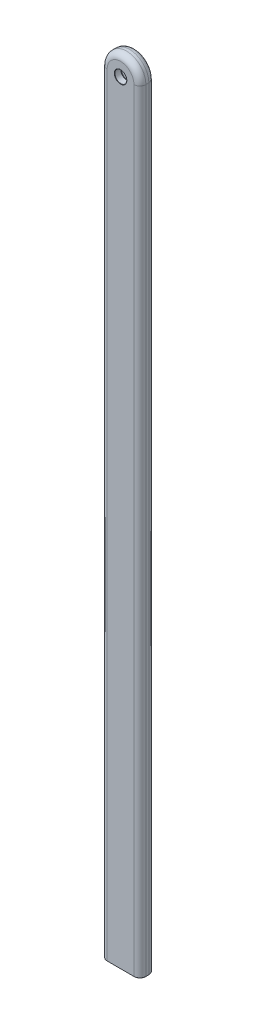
ISO-10303-21;
HEADER;
FILE_DESCRIPTION(('STEP AP214'),'2;1');
FILE_NAME('part.step','',(''),(''),'','','');
FILE_SCHEMA(('AUTOMOTIVE_DESIGN { 1 0 10303 214 1 1 1 1 }'));
ENDSEC;
DATA;
#1=APPLICATION_CONTEXT('core data for automotive mechanical design processes');
#2=APPLICATION_PROTOCOL_DEFINITION('international standard','automotive_design',2000,#1);
#3=PRODUCT_CONTEXT('',#1,'mechanical');
#4=PRODUCT('Part','Part','',(#3));
#5=PRODUCT_RELATED_PRODUCT_CATEGORY('part','',(#4));
#6=PRODUCT_DEFINITION_FORMATION('','',#4);
#7=PRODUCT_DEFINITION_CONTEXT('part definition',#1,'design');
#8=PRODUCT_DEFINITION('design','',#6,#7);
#9=PRODUCT_DEFINITION_SHAPE('','',#8);
#10=(LENGTH_UNIT() NAMED_UNIT(*) SI_UNIT(.MILLI.,.METRE.));
#11=(NAMED_UNIT(*) PLANE_ANGLE_UNIT() SI_UNIT($,.RADIAN.));
#12=(NAMED_UNIT(*) SI_UNIT($,.STERADIAN.) SOLID_ANGLE_UNIT());
#13=UNCERTAINTY_MEASURE_WITH_UNIT(LENGTH_MEASURE(1.E-05),#10,'distance_accuracy_value','');
#14=(GEOMETRIC_REPRESENTATION_CONTEXT(3) GLOBAL_UNCERTAINTY_ASSIGNED_CONTEXT((#13)) GLOBAL_UNIT_ASSIGNED_CONTEXT((#10,
#11,#12)) REPRESENTATION_CONTEXT('',''));
#15=CARTESIAN_POINT('',(0.,0.,0.));
#16=DIRECTION('',(0.,0.,1.));
#17=DIRECTION('',(1.,0.,0.));
#18=AXIS2_PLACEMENT_3D('',#15,#16,#17);
#19=CARTESIAN_POINT('',(-32.5,0.,12.5));
#20=DIRECTION('',(1.,0.,0.));
#21=DIRECTION('',(0.,1.,0.));
#22=AXIS2_PLACEMENT_3D('',#19,#20,#21);
#23=PLANE('',#22);
#24=DIRECTION('',(0.,-1.,0.));
#25=VECTOR('',#24,1.);
#26=CARTESIAN_POINT('',(-32.5,0.,2.5));
#27=LINE('',#26,#25);
#28=CARTESIAN_POINT('',(-32.4999999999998,-1297.,2.5));
#29=VERTEX_POINT('',#28);
#30=CARTESIAN_POINT('',(-32.5,-53.2678176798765,2.5));
#31=VERTEX_POINT('',#30);
#32=EDGE_CURVE('E340',#29,#31,#27,.F.);
#33=ORIENTED_EDGE('',*,*,#32,.T.);
#34=CARTESIAN_POINT('',(-32.5,-48.5,0.));
#35=DIRECTION('',(1.,0.,0.));
#36=DIRECTION('',(0.,1.,0.));
#37=AXIS2_PLACEMENT_3D('',#34,#35,#36);
#38=CIRCLE('',#37,5.3835012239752);
#39=CARTESIAN_POINT('',(-32.5,-53.2678176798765,-2.5));
#40=VERTEX_POINT('',#39);
#41=EDGE_CURVE('E347',#31,#40,#38,.T.);
#42=ORIENTED_EDGE('',*,*,#41,.T.);
#43=DIRECTION('',(0.,-1.,0.));
#44=VECTOR('',#43,1.);
#45=CARTESIAN_POINT('',(-32.5,0.,-2.5));
#46=LINE('',#45,#44);
#47=CARTESIAN_POINT('',(-32.4999999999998,-1297.,-2.5));
#48=VERTEX_POINT('',#47);
#49=EDGE_CURVE('E325',#40,#48,#46,.T.);
#50=ORIENTED_EDGE('',*,*,#49,.T.);
#51=DIRECTION('',(0.,0.,1.));
#52=VECTOR('',#51,1.);
#53=CARTESIAN_POINT('',(-32.4999999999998,-1297.,12.5));
#54=LINE('',#53,#52);
#55=EDGE_CURVE('E345',#48,#29,#54,.T.);
#56=ORIENTED_EDGE('',*,*,#55,.T.);
#57=EDGE_LOOP('',(#33,#42,#50,#56));
#58=FACE_BOUND('',#57,.T.);
#59=ADVANCED_FACE('F31',(#58),#23,.F.);
#60=CARTESIAN_POINT('',(-32.5,-33.2678176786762,-2.5));
#61=VERTEX_POINT('',#60);
#62=CARTESIAN_POINT('',(-32.5,-43.7321823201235,-2.5));
#63=VERTEX_POINT('',#62);
#64=EDGE_CURVE('E320',#61,#63,#46,.T.);
#65=ORIENTED_EDGE('',*,*,#64,.T.);
#66=CARTESIAN_POINT('',(-32.5,-48.5,0.));
#67=DIRECTION('',(1.,0.,0.));
#68=DIRECTION('',(0.,1.,0.));
#69=AXIS2_PLACEMENT_3D('',#66,#67,#68);
#70=CIRCLE('',#69,5.3835012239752);
#71=CARTESIAN_POINT('',(-32.5,-43.7321823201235,2.5));
#72=VERTEX_POINT('',#71);
#73=EDGE_CURVE('E1225',#63,#72,#70,.T.);
#74=ORIENTED_EDGE('',*,*,#73,.T.);
#75=CARTESIAN_POINT('',(-32.5,-33.2678176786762,2.5));
#76=VERTEX_POINT('',#75);
#77=EDGE_CURVE('E180',#72,#76,#27,.F.);
#78=ORIENTED_EDGE('',*,*,#77,.T.);
#79=CARTESIAN_POINT('',(-32.5,-28.5,0.));
#80=DIRECTION('',(1.,0.,0.));
#81=DIRECTION('',(0.,1.,0.));
#82=AXIS2_PLACEMENT_3D('',#79,#80,#81);
#83=CIRCLE('',#82,5.38350122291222);
#84=EDGE_CURVE('E319',#76,#61,#83,.T.);
#85=ORIENTED_EDGE('',*,*,#84,.T.);
#86=EDGE_LOOP('',(#65,#74,#78,#85));
#87=FACE_BOUND('',#86,.T.);
#88=ADVANCED_FACE('F741',(#87),#23,.F.);
#89=CARTESIAN_POINT('',(0.,0.,12.5));
#90=DIRECTION('',(0.,0.,-1.));
#91=DIRECTION('',(-1.,0.,0.));
#92=AXIS2_PLACEMENT_3D('',#89,#90,#91);
#93=CYLINDRICAL_SURFACE('',#92,32.5);
#94=DIRECTION('',(0.,0.,-1.));
#95=VECTOR('',#94,1.);
#96=CARTESIAN_POINT('',(32.5,0.,12.5));
#97=LINE('',#96,#95);
#98=CARTESIAN_POINT('',(32.5,0.,2.5));
#99=VERTEX_POINT('',#98);
#100=CARTESIAN_POINT('',(32.5,0.,-2.5));
#101=VERTEX_POINT('',#100);
#102=EDGE_CURVE('E190',#99,#101,#97,.T.);
#103=ORIENTED_EDGE('',*,*,#102,.T.);
#104=CARTESIAN_POINT('',(0.,0.,-2.5));
#105=DIRECTION('',(0.,0.,1.));
#106=DIRECTION('',(1.,0.,0.));
#107=AXIS2_PLACEMENT_3D('',#104,#105,#106);
#108=CIRCLE('',#107,32.5);
#109=CARTESIAN_POINT('',(-32.5,0.,-2.5));
#110=VERTEX_POINT('',#109);
#111=EDGE_CURVE('E189',#101,#110,#108,.T.);
#112=ORIENTED_EDGE('',*,*,#111,.T.);
#113=DIRECTION('',(0.,0.,-1.));
#114=VECTOR('',#113,1.);
#115=CARTESIAN_POINT('',(-32.5,0.,12.5));
#116=LINE('',#115,#114);
#117=CARTESIAN_POINT('',(-32.5,0.,2.5));
#118=VERTEX_POINT('',#117);
#119=EDGE_CURVE('E174',#118,#110,#116,.T.);
#120=ORIENTED_EDGE('',*,*,#119,.F.);
#121=CARTESIAN_POINT('',(0.,0.,2.5));
#122=DIRECTION('',(0.,0.,1.));
#123=DIRECTION('',(1.,0.,0.));
#124=AXIS2_PLACEMENT_3D('',#121,#122,#123);
#125=CIRCLE('',#124,32.5);
#126=EDGE_CURVE('E186',#118,#99,#125,.F.);
#127=ORIENTED_EDGE('',*,*,#126,.T.);
#128=EDGE_LOOP('',(#103,#112,#120,#127));
#129=FACE_BOUND('',#128,.T.);
#130=ADVANCED_FACE('F185',(#129),#93,.T.);
#131=CARTESIAN_POINT('',(-32.5,-23.7321823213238,-2.5));
#132=VERTEX_POINT('',#131);
#133=EDGE_CURVE('E324',#110,#132,#46,.T.);
#134=ORIENTED_EDGE('',*,*,#133,.T.);
#135=CARTESIAN_POINT('',(-32.5,-28.5,0.));
#136=DIRECTION('',(1.,0.,0.));
#137=DIRECTION('',(0.,1.,0.));
#138=AXIS2_PLACEMENT_3D('',#135,#136,#137);
#139=CIRCLE('',#138,5.38350122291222);
#140=CARTESIAN_POINT('',(-32.5,-23.7321823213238,2.5));
#141=VERTEX_POINT('',#140);
#142=EDGE_CURVE('E177',#132,#141,#139,.T.);
#143=ORIENTED_EDGE('',*,*,#142,.T.);
#144=EDGE_CURVE('E170',#141,#118,#27,.F.);
#145=ORIENTED_EDGE('',*,*,#144,.T.);
#146=ORIENTED_EDGE('',*,*,#119,.T.);
#147=EDGE_LOOP('',(#134,#143,#145,#146));
#148=FACE_BOUND('',#147,.T.);
#149=ADVANCED_FACE('F173',(#148),#23,.F.);
#150=CARTESIAN_POINT('',(-32.4999999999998,-1297.5,12.5));
#151=DIRECTION('',(0.,1.,0.));
#152=DIRECTION('',(0.,0.,1.));
#153=AXIS2_PLACEMENT_3D('',#150,#151,#152);
#154=PLANE('',#153);
#155=CARTESIAN_POINT('',(19.,-1297.5,0.));
#156=DIRECTION('',(0.,1.,0.));
#157=DIRECTION('',(0.,0.,1.));
#158=AXIS2_PLACEMENT_3D('',#155,#156,#157);
#159=CIRCLE('',#158,5.49999999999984);
#160=CARTESIAN_POINT('',(19.,-1297.5,5.49999999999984));
#161=VERTEX_POINT('',#160);
#162=EDGE_CURVE('E247',#161,#161,#159,.T.);
#163=ORIENTED_EDGE('',*,*,#162,.T.);
#164=EDGE_LOOP('',(#163));
#165=FACE_BOUND('',#164,.T.);
#166=CARTESIAN_POINT('',(0.,-1297.5,0.));
#167=DIRECTION('',(0.,1.,0.));
#168=DIRECTION('',(0.,0.,1.));
#169=AXIS2_PLACEMENT_3D('',#166,#167,#168);
#170=CIRCLE('',#169,5.49999999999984);
#171=CARTESIAN_POINT('',(0.,-1297.5,5.49999999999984));
#172=VERTEX_POINT('',#171);
#173=EDGE_CURVE('E244',#172,#172,#170,.T.);
#174=ORIENTED_EDGE('',*,*,#173,.T.);
#175=EDGE_LOOP('',(#174));
#176=FACE_BOUND('',#175,.T.);
#177=CARTESIAN_POINT('',(-19.,-1297.5,0.));
#178=DIRECTION('',(0.,1.,0.));
#179=DIRECTION('',(0.,0.,1.));
#180=AXIS2_PLACEMENT_3D('',#177,#178,#179);
#181=CIRCLE('',#180,5.49999999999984);
#182=CARTESIAN_POINT('',(-19.,-1297.5,5.49999999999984));
#183=VERTEX_POINT('',#182);
#184=EDGE_CURVE('E241',#183,#183,#181,.T.);
#185=ORIENTED_EDGE('',*,*,#184,.T.);
#186=EDGE_LOOP('',(#185));
#187=FACE_BOUND('',#186,.T.);
#188=CARTESIAN_POINT('',(-22.4999999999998,-1297.5,-2.5));
#189=DIRECTION('',(0.,1.,0.));
#190=DIRECTION('',(0.,0.,1.));
#191=AXIS2_PLACEMENT_3D('',#188,#189,#190);
#192=CIRCLE('',#191,9.49999999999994);
#193=CARTESIAN_POINT('',(-31.9999999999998,-1297.5,-2.5));
#194=VERTEX_POINT('',#193);
#195=CARTESIAN_POINT('',(-22.4999999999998,-1297.5,-11.9999999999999));
#196=VERTEX_POINT('',#195);
#197=EDGE_CURVE('E236',#194,#196,#192,.F.);
#198=ORIENTED_EDGE('',*,*,#197,.T.);
#199=DIRECTION('',(1.,0.,0.));
#200=VECTOR('',#199,1.);
#201=CARTESIAN_POINT('',(-32.4999999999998,-1297.5,-11.9999999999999));
#202=LINE('',#201,#200);
#203=CARTESIAN_POINT('',(22.4999999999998,-1297.5,-11.9999999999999));
#204=VERTEX_POINT('',#203);
#205=EDGE_CURVE('E238',#196,#204,#202,.T.);
#206=ORIENTED_EDGE('',*,*,#205,.T.);
#207=CARTESIAN_POINT('',(22.4999999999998,-1297.5,-2.5));
#208=DIRECTION('',(0.,1.,0.));
#209=DIRECTION('',(0.,0.,1.));
#210=AXIS2_PLACEMENT_3D('',#207,#208,#209);
#211=CIRCLE('',#210,9.49999999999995);
#212=CARTESIAN_POINT('',(31.9999999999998,-1297.5,-2.5));
#213=VERTEX_POINT('',#212);
#214=EDGE_CURVE('E234',#204,#213,#211,.F.);
#215=ORIENTED_EDGE('',*,*,#214,.T.);
#216=DIRECTION('',(0.,0.,1.));
#217=VECTOR('',#216,1.);
#218=CARTESIAN_POINT('',(31.9999999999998,-1297.5,12.5));
#219=LINE('',#218,#217);
#220=CARTESIAN_POINT('',(31.9999999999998,-1297.5,2.5));
#221=VERTEX_POINT('',#220);
#222=EDGE_CURVE('E230',#213,#221,#219,.T.);
#223=ORIENTED_EDGE('',*,*,#222,.T.);
#224=CARTESIAN_POINT('',(22.4999999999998,-1297.5,2.5));
#225=DIRECTION('',(0.,1.,0.));
#226=DIRECTION('',(0.,0.,1.));
#227=AXIS2_PLACEMENT_3D('',#224,#225,#226);
#228=CIRCLE('',#227,9.49999999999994);
#229=CARTESIAN_POINT('',(22.4999999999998,-1297.5,11.9999999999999));
#230=VERTEX_POINT('',#229);
#231=EDGE_CURVE('E226',#221,#230,#228,.F.);
#232=ORIENTED_EDGE('',*,*,#231,.T.);
#233=DIRECTION('',(-1.,0.,0.));
#234=VECTOR('',#233,1.);
#235=CARTESIAN_POINT('',(-22.4999999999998,-1297.5,11.9999999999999));
#236=LINE('',#235,#234);
#237=CARTESIAN_POINT('',(-22.4999999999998,-1297.5,11.9999999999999));
#238=VERTEX_POINT('',#237);
#239=EDGE_CURVE('E224',#230,#238,#236,.T.);
#240=ORIENTED_EDGE('',*,*,#239,.T.);
#241=CARTESIAN_POINT('',(-22.4999999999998,-1297.5,2.5));
#242=DIRECTION('',(0.,1.,0.));
#243=DIRECTION('',(0.,0.,1.));
#244=AXIS2_PLACEMENT_3D('',#241,#242,#243);
#245=CIRCLE('',#244,9.49999999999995);
#246=CARTESIAN_POINT('',(-31.9999999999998,-1297.5,2.5));
#247=VERTEX_POINT('',#246);
#248=EDGE_CURVE('E228',#238,#247,#245,.F.);
#249=ORIENTED_EDGE('',*,*,#248,.T.);
#250=DIRECTION('',(0.,0.,-1.));
#251=VECTOR('',#250,1.);
#252=CARTESIAN_POINT('',(-31.9999999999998,-1297.5,12.5));
#253=LINE('',#252,#251);
#254=EDGE_CURVE('E232',#247,#194,#253,.T.);
#255=ORIENTED_EDGE('',*,*,#254,.T.);
#256=EDGE_LOOP('',(#198,#206,#215,#223,#232,#240,#249,#255));
#257=FACE_BOUND('',#256,.T.);
#258=ADVANCED_FACE('F750',(#165,#176,#187,#257),#154,.F.);
#259=CARTESIAN_POINT('',(32.4999999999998,-1297.5,12.5));
#260=DIRECTION('',(-1.,0.,0.));
#261=DIRECTION('',(0.,-1.,0.));
#262=AXIS2_PLACEMENT_3D('',#259,#260,#261);
#263=PLANE('',#262);
#264=DIRECTION('',(0.,1.,0.));
#265=VECTOR('',#264,1.);
#266=CARTESIAN_POINT('',(32.4999999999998,-1297.5,2.5));
#267=LINE('',#266,#265);
#268=CARTESIAN_POINT('',(32.4999999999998,-1297.,2.5));
#269=VERTEX_POINT('',#268);
#270=EDGE_CURVE('E1184',#99,#269,#267,.F.);
#271=ORIENTED_EDGE('',*,*,#270,.T.);
#272=DIRECTION('',(0.,0.,-1.));
#273=VECTOR('',#272,1.);
#274=CARTESIAN_POINT('',(32.4999999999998,-1297.,12.5));
#275=LINE('',#274,#273);
#276=CARTESIAN_POINT('',(32.4999999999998,-1297.,-2.5));
#277=VERTEX_POINT('',#276);
#278=EDGE_CURVE('E40',#269,#277,#275,.T.);
#279=ORIENTED_EDGE('',*,*,#278,.T.);
#280=DIRECTION('',(0.,1.,0.));
#281=VECTOR('',#280,1.);
#282=CARTESIAN_POINT('',(32.4999999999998,-1297.5,-2.5));
#283=LINE('',#282,#281);
#284=EDGE_CURVE('E221',#277,#101,#283,.T.);
#285=ORIENTED_EDGE('',*,*,#284,.T.);
#286=ORIENTED_EDGE('',*,*,#102,.F.);
#287=EDGE_LOOP('',(#271,#279,#285,#286));
#288=FACE_BOUND('',#287,.T.);
#289=ADVANCED_FACE('F755',(#288),#263,.F.);
#290=CARTESIAN_POINT('',(0.,0.,12.5));
#291=DIRECTION('',(0.,0.,1.));
#292=DIRECTION('',(1.,0.,0.));
#293=AXIS2_PLACEMENT_3D('',#290,#291,#292);
#294=PLANE('',#293);
#295=CARTESIAN_POINT('',(0.,0.,12.5));
#296=DIRECTION('',(0.,0.,1.));
#297=DIRECTION('',(1.,0.,0.));
#298=AXIS2_PLACEMENT_3D('',#295,#296,#297);
#299=CIRCLE('',#298,10.5000000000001);
#300=CARTESIAN_POINT('',(10.5000000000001,0.,12.5));
#301=VERTEX_POINT('',#300);
#302=EDGE_CURVE('E445',#301,#301,#299,.F.);
#303=ORIENTED_EDGE('',*,*,#302,.T.);
#304=EDGE_LOOP('',(#303));
#305=FACE_BOUND('',#304,.T.);
#306=DIRECTION('',(0.,-1.,0.));
#307=VECTOR('',#306,1.);
#308=CARTESIAN_POINT('',(-22.4999999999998,-1297.5,12.5));
#309=LINE('',#308,#307);
#310=CARTESIAN_POINT('',(-22.5,0.,12.5));
#311=VERTEX_POINT('',#310);
#312=CARTESIAN_POINT('',(-22.4999999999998,-1297.,12.5));
#313=VERTEX_POINT('',#312);
#314=EDGE_CURVE('E206',#311,#313,#309,.T.);
#315=ORIENTED_EDGE('',*,*,#314,.T.);
#316=DIRECTION('',(1.,0.,0.));
#317=VECTOR('',#316,1.);
#318=CARTESIAN_POINT('',(22.4999999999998,-1297.,12.5));
#319=LINE('',#318,#317);
#320=CARTESIAN_POINT('',(22.4999999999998,-1297.,12.5));
#321=VERTEX_POINT('',#320);
#322=EDGE_CURVE('E443',#313,#321,#319,.T.);
#323=ORIENTED_EDGE('',*,*,#322,.T.);
#324=DIRECTION('',(0.,1.,0.));
#325=VECTOR('',#324,1.);
#326=CARTESIAN_POINT('',(22.5,0.,12.5));
#327=LINE('',#326,#325);
#328=CARTESIAN_POINT('',(22.5,0.,12.5));
#329=VERTEX_POINT('',#328);
#330=EDGE_CURVE('E1179',#321,#329,#327,.T.);
#331=ORIENTED_EDGE('',*,*,#330,.T.);
#332=CARTESIAN_POINT('',(0.,0.,12.5));
#333=DIRECTION('',(0.,0.,1.));
#334=DIRECTION('',(1.,0.,0.));
#335=AXIS2_PLACEMENT_3D('',#332,#333,#334);
#336=CIRCLE('',#335,22.5);
#337=EDGE_CURVE('E1181',#329,#311,#336,.T.);
#338=ORIENTED_EDGE('',*,*,#337,.T.);
#339=EDGE_LOOP('',(#315,#323,#331,#338));
#340=FACE_BOUND('',#339,.T.);
#341=ADVANCED_FACE('F787',(#305,#340),#294,.T.);
#342=CARTESIAN_POINT('',(0.,0.,-12.5));
#343=DIRECTION('',(0.,0.,1.));
#344=DIRECTION('',(1.,0.,0.));
#345=AXIS2_PLACEMENT_3D('',#342,#343,#344);
#346=PLANE('',#345);
#347=DIRECTION('',(0.,1.,0.));
#348=VECTOR('',#347,1.);
#349=CARTESIAN_POINT('',(22.5,0.,-12.5));
#350=LINE('',#349,#348);
#351=CARTESIAN_POINT('',(22.5,0.,-12.5));
#352=VERTEX_POINT('',#351);
#353=CARTESIAN_POINT('',(22.4999999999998,-1297.,-12.5));
#354=VERTEX_POINT('',#353);
#355=EDGE_CURVE('E331',#352,#354,#350,.F.);
#356=ORIENTED_EDGE('',*,*,#355,.T.);
#357=DIRECTION('',(-1.,0.,0.));
#358=VECTOR('',#357,1.);
#359=CARTESIAN_POINT('',(0.,-1297.,-12.5));
#360=LINE('',#359,#358);
#361=CARTESIAN_POINT('',(-22.4999999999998,-1297.,-12.5));
#362=VERTEX_POINT('',#361);
#363=EDGE_CURVE('E451',#354,#362,#360,.T.);
#364=ORIENTED_EDGE('',*,*,#363,.T.);
#365=DIRECTION('',(0.,-1.,0.));
#366=VECTOR('',#365,1.);
#367=CARTESIAN_POINT('',(-22.5,0.,-12.5));
#368=LINE('',#367,#366);
#369=CARTESIAN_POINT('',(-22.5,0.,-12.5));
#370=VERTEX_POINT('',#369);
#371=EDGE_CURVE('E201',#362,#370,#368,.F.);
#372=ORIENTED_EDGE('',*,*,#371,.T.);
#373=CARTESIAN_POINT('',(0.,0.,-12.5));
#374=DIRECTION('',(0.,0.,1.));
#375=DIRECTION('',(1.,0.,0.));
#376=AXIS2_PLACEMENT_3D('',#373,#374,#375);
#377=CIRCLE('',#376,22.5);
#378=EDGE_CURVE('E1175',#370,#352,#377,.F.);
#379=ORIENTED_EDGE('',*,*,#378,.T.);
#380=EDGE_LOOP('',(#356,#364,#372,#379));
#381=FACE_BOUND('',#380,.T.);
#382=ADVANCED_FACE('F796',(#381),#346,.F.);
#383=CARTESIAN_POINT('',(22.4999999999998,-1297.5,-2.5));
#384=DIRECTION('',(0.,1.,0.));
#385=DIRECTION('',(-1.,0.,0.));
#386=AXIS2_PLACEMENT_3D('',#383,#384,#385);
#387=CYLINDRICAL_SURFACE('',#386,10.);
#388=ORIENTED_EDGE('',*,*,#284,.F.);
#389=CARTESIAN_POINT('',(22.4999999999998,-1297.,-2.5));
#390=DIRECTION('',(0.,1.,0.));
#391=DIRECTION('',(0.,0.,1.));
#392=AXIS2_PLACEMENT_3D('',#389,#390,#391);
#393=CIRCLE('',#392,10.);
#394=EDGE_CURVE('E454',#277,#354,#393,.T.);
#395=ORIENTED_EDGE('',*,*,#394,.T.);
#396=ORIENTED_EDGE('',*,*,#355,.F.);
#397=CARTESIAN_POINT('',(22.5,0.,-2.5));
#398=DIRECTION('',(0.,1.,0.));
#399=DIRECTION('',(0.,0.,1.));
#400=AXIS2_PLACEMENT_3D('',#397,#398,#399);
#401=CIRCLE('',#400,10.);
#402=EDGE_CURVE('E214',#101,#352,#401,.T.);
#403=ORIENTED_EDGE('',*,*,#402,.F.);
#404=EDGE_LOOP('',(#388,#395,#396,#403));
#405=FACE_BOUND('',#404,.T.);
#406=ADVANCED_FACE('F806',(#405),#387,.T.);
#407=CARTESIAN_POINT('',(0.,0.,-2.5));
#408=DIRECTION('',(0.,0.,1.));
#409=DIRECTION('',(1.,0.,0.));
#410=AXIS2_PLACEMENT_3D('',#407,#408,#409);
#411=TOROIDAL_SURFACE('',#410,22.5,10.);
#412=ORIENTED_EDGE('',*,*,#402,.T.);
#413=ORIENTED_EDGE('',*,*,#378,.F.);
#414=CARTESIAN_POINT('',(-22.5,0.,-2.5));
#415=DIRECTION('',(0.,-1.,0.));
#416=DIRECTION('',(0.,0.,-1.));
#417=AXIS2_PLACEMENT_3D('',#414,#415,#416);
#418=CIRCLE('',#417,10.);
#419=EDGE_CURVE('E209',#110,#370,#418,.T.);
#420=ORIENTED_EDGE('',*,*,#419,.F.);
#421=ORIENTED_EDGE('',*,*,#111,.F.);
#422=EDGE_LOOP('',(#412,#413,#420,#421));
#423=FACE_BOUND('',#422,.T.);
#424=ADVANCED_FACE('F376',(#423),#411,.T.);
#425=CARTESIAN_POINT('',(-22.5,0.,-2.5));
#426=DIRECTION('',(0.,-1.,0.));
#427=DIRECTION('',(1.,0.,0.));
#428=AXIS2_PLACEMENT_3D('',#425,#426,#427);
#429=CYLINDRICAL_SURFACE('',#428,10.);
#430=ORIENTED_EDGE('',*,*,#49,.F.);
#431=CARTESIAN_POINT('',(-32.5,-43.7321823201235,-2.5));
#432=CARTESIAN_POINT('',(-32.4999429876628,-44.1934485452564,-3.40451116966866));
#433=CARTESIAN_POINT('',(-32.3776324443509,-44.8860210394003,-4.15352355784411));
#434=CARTESIAN_POINT('',(-32.1449124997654,-46.5501548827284,-5.19046526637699));
#435=CARTESIAN_POINT('',(-32.0484820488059,-47.5224672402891,-5.47097156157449));
#436=CARTESIAN_POINT('',(-32.0493145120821,-49.4824698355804,-5.4682343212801));
#437=CARTESIAN_POINT('',(-32.1458730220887,-50.4558048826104,-5.18667730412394));
#438=CARTESIAN_POINT('',(-32.3786100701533,-52.1220225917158,-4.14859200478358));
#439=CARTESIAN_POINT('',(-32.5008169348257,-52.8147643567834,-3.39432808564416));
#440=CARTESIAN_POINT('',(-32.5,-53.2678176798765,-2.5));
#441=B_SPLINE_CURVE_WITH_KNOTS('',3,(#431,#432,#433,#434,#435,#436,#437,#438,#439,#440),
.UNSPECIFIED.,.F.,.F.,(4,2,2,2,4),(0.,0.00292158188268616,0.00584316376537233,
0.00876474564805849,0.0116863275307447),.UNSPECIFIED.);
#442=EDGE_CURVE('E392',#40,#63,#441,.F.);
#443=ORIENTED_EDGE('',*,*,#442,.T.);
#444=ORIENTED_EDGE('',*,*,#64,.F.);
#445=CARTESIAN_POINT('',(-32.5,-23.7321823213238,-2.5));
#446=CARTESIAN_POINT('',(-32.4999429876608,-24.1934485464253,-3.40451116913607));
#447=CARTESIAN_POINT('',(-32.3776324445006,-24.8860210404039,-4.15352355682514));
#448=CARTESIAN_POINT('',(-32.1449125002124,-26.5501548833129,-5.19046526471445));
#449=CARTESIAN_POINT('',(-32.048482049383,-27.5224672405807,-5.47097155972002));
#450=CARTESIAN_POINT('',(-32.0493145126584,-29.4824698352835,-5.46823431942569));
#451=CARTESIAN_POINT('',(-32.1458730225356,-30.4558048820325,-5.18667730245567));
#452=CARTESIAN_POINT('',(-32.3786100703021,-32.1220225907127,-4.14859200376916));
#453=CARTESIAN_POINT('',(-32.5008169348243,-32.8147643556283,-3.39432808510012));
#454=CARTESIAN_POINT('',(-32.5,-33.2678176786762,-2.5));
#455=B_SPLINE_CURVE_WITH_KNOTS('',3,(#445,#446,#447,#448,#449,#450,#451,#452,#453,#454),
.UNSPECIFIED.,.F.,.F.,(4,2,2,2,4),(0.,0.00292158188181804,0.00584316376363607,
0.00876474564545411,0.0116863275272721),.UNSPECIFIED.);
#456=EDGE_CURVE('E354',#61,#132,#455,.F.);
#457=ORIENTED_EDGE('',*,*,#456,.T.);
#458=ORIENTED_EDGE('',*,*,#133,.F.);
#459=ORIENTED_EDGE('',*,*,#419,.T.);
#460=ORIENTED_EDGE('',*,*,#371,.F.);
#461=CARTESIAN_POINT('',(-22.4999999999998,-1297.,-2.5));
#462=DIRECTION('',(0.,1.,0.));
#463=DIRECTION('',(0.,0.,1.));
#464=AXIS2_PLACEMENT_3D('',#461,#462,#463);
#465=CIRCLE('',#464,10.);
#466=EDGE_CURVE('E350',#362,#48,#465,.T.);
#467=ORIENTED_EDGE('',*,*,#466,.T.);
#468=EDGE_LOOP('',(#430,#443,#444,#457,#458,#459,#460,#467));
#469=FACE_BOUND('',#468,.T.);
#470=ADVANCED_FACE('F365',(#469),#429,.T.);
#471=CARTESIAN_POINT('',(22.5,0.,2.5));
#472=DIRECTION('',(0.,-1.,0.));
#473=DIRECTION('',(1.,0.,0.));
#474=AXIS2_PLACEMENT_3D('',#471,#472,#473);
#475=CYLINDRICAL_SURFACE('',#474,10.);
#476=ORIENTED_EDGE('',*,*,#330,.F.);
#477=CARTESIAN_POINT('',(22.4999999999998,-1297.,2.5));
#478=DIRECTION('',(0.,1.,0.));
#479=DIRECTION('',(0.,0.,1.));
#480=AXIS2_PLACEMENT_3D('',#477,#478,#479);
#481=CIRCLE('',#480,10.);
#482=EDGE_CURVE('E11',#321,#269,#481,.T.);
#483=ORIENTED_EDGE('',*,*,#482,.T.);
#484=ORIENTED_EDGE('',*,*,#270,.F.);
#485=CARTESIAN_POINT('',(22.5,0.,2.5));
#486=DIRECTION('',(0.,1.,0.));
#487=DIRECTION('',(0.,0.,1.));
#488=AXIS2_PLACEMENT_3D('',#485,#486,#487);
#489=CIRCLE('',#488,10.);
#490=EDGE_CURVE('E200',#329,#99,#489,.T.);
#491=ORIENTED_EDGE('',*,*,#490,.F.);
#492=EDGE_LOOP('',(#476,#483,#484,#491));
#493=FACE_BOUND('',#492,.T.);
#494=ADVANCED_FACE('F375',(#493),#475,.T.);
#495=CARTESIAN_POINT('',(0.,0.,2.5));
#496=DIRECTION('',(0.,0.,1.));
#497=DIRECTION('',(1.,0.,0.));
#498=AXIS2_PLACEMENT_3D('',#495,#496,#497);
#499=TOROIDAL_SURFACE('',#498,22.5,10.);
#500=ORIENTED_EDGE('',*,*,#490,.T.);
#501=ORIENTED_EDGE('',*,*,#126,.F.);
#502=CARTESIAN_POINT('',(-22.5,0.,2.5));
#503=DIRECTION('',(0.,-1.,0.));
#504=DIRECTION('',(1.,0.,0.));
#505=AXIS2_PLACEMENT_3D('',#502,#503,#504);
#506=CIRCLE('',#505,10.);
#507=EDGE_CURVE('E197',#311,#118,#506,.T.);
#508=ORIENTED_EDGE('',*,*,#507,.F.);
#509=ORIENTED_EDGE('',*,*,#337,.F.);
#510=EDGE_LOOP('',(#500,#501,#508,#509));
#511=FACE_BOUND('',#510,.T.);
#512=ADVANCED_FACE('F195',(#511),#499,.T.);
#513=CARTESIAN_POINT('',(-22.5,0.,2.5));
#514=DIRECTION('',(0.,1.,0.));
#515=DIRECTION('',(-1.,0.,0.));
#516=AXIS2_PLACEMENT_3D('',#513,#514,#515);
#517=CYLINDRICAL_SURFACE('',#516,10.);
#518=ORIENTED_EDGE('',*,*,#77,.F.);
#519=CARTESIAN_POINT('',(-32.5,-53.2678176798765,2.5));
#520=CARTESIAN_POINT('',(-32.4999429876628,-52.8065514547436,3.40451116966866));
#521=CARTESIAN_POINT('',(-32.3776324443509,-52.1139789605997,4.15352355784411));
#522=CARTESIAN_POINT('',(-32.1449124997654,-50.4498451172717,5.190465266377));
#523=CARTESIAN_POINT('',(-32.0484820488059,-49.4775327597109,5.4709715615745));
#524=CARTESIAN_POINT('',(-32.0493145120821,-47.5175301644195,5.4682343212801));
#525=CARTESIAN_POINT('',(-32.1458730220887,-46.5441951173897,5.18667730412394));
#526=CARTESIAN_POINT('',(-32.3786100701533,-44.8779774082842,4.14859200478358));
#527=CARTESIAN_POINT('',(-32.5008169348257,-44.1852356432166,3.39432808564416));
#528=CARTESIAN_POINT('',(-32.5,-43.7321823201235,2.5));
#529=B_SPLINE_CURVE_WITH_KNOTS('',3,(#519,#520,#521,#522,#523,#524,#525,#526,#527,#528),
.UNSPECIFIED.,.F.,.F.,(4,2,2,2,4),(0.,0.00292158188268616,0.00584316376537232,
0.00876474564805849,0.0116863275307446),.UNSPECIFIED.);
#530=EDGE_CURVE('E348',#72,#31,#529,.F.);
#531=ORIENTED_EDGE('',*,*,#530,.T.);
#532=ORIENTED_EDGE('',*,*,#32,.F.);
#533=CARTESIAN_POINT('',(-22.4999999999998,-1297.,2.5));
#534=DIRECTION('',(0.,1.,0.));
#535=DIRECTION('',(0.,0.,1.));
#536=AXIS2_PLACEMENT_3D('',#533,#534,#535);
#537=CIRCLE('',#536,10.);
#538=EDGE_CURVE('E1226',#29,#313,#537,.T.);
#539=ORIENTED_EDGE('',*,*,#538,.T.);
#540=ORIENTED_EDGE('',*,*,#314,.F.);
#541=ORIENTED_EDGE('',*,*,#507,.T.);
#542=ORIENTED_EDGE('',*,*,#144,.F.);
#543=CARTESIAN_POINT('',(-32.5,-33.2678176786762,2.5));
#544=CARTESIAN_POINT('',(-32.4999429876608,-32.8065514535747,3.40451116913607));
#545=CARTESIAN_POINT('',(-32.3776324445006,-32.1139789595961,4.15352355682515));
#546=CARTESIAN_POINT('',(-32.1449125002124,-30.4498451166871,5.19046526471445));
#547=CARTESIAN_POINT('',(-32.048482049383,-29.4775327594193,5.47097155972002));
#548=CARTESIAN_POINT('',(-32.0493145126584,-27.5175301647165,5.46823431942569));
#549=CARTESIAN_POINT('',(-32.1458730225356,-26.5441951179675,5.18667730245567));
#550=CARTESIAN_POINT('',(-32.3786100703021,-24.8779774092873,4.14859200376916));
#551=CARTESIAN_POINT('',(-32.5008169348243,-24.1852356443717,3.39432808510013));
#552=CARTESIAN_POINT('',(-32.5,-23.7321823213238,2.5));
#553=B_SPLINE_CURVE_WITH_KNOTS('',3,(#543,#544,#545,#546,#547,#548,#549,#550,#551,#552),
.UNSPECIFIED.,.F.,.F.,(4,2,2,2,4),(0.,0.00292158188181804,0.00584316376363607,
0.00876474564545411,0.0116863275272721),.UNSPECIFIED.);
#554=EDGE_CURVE('E663',#141,#76,#553,.F.);
#555=ORIENTED_EDGE('',*,*,#554,.T.);
#556=EDGE_LOOP('',(#518,#531,#532,#539,#540,#541,#542,#555));
#557=FACE_BOUND('',#556,.T.);
#558=ADVANCED_FACE('F204',(#557),#517,.T.);
#559=CARTESIAN_POINT('',(0.,0.,1.5));
#560=DIRECTION('',(0.,0.,1.));
#561=DIRECTION('',(1.,0.,0.));
#562=AXIS2_PLACEMENT_3D('',#559,#560,#561);
#563=CYLINDRICAL_SURFACE('',#562,10.);
#564=CARTESIAN_POINT('',(0.,0.,11.9999999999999));
#565=DIRECTION('',(0.,0.,1.));
#566=DIRECTION('',(1.,0.,0.));
#567=AXIS2_PLACEMENT_3D('',#564,#565,#566);
#568=CIRCLE('',#567,10.);
#569=CARTESIAN_POINT('',(10.,0.,11.9999999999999));
#570=VERTEX_POINT('',#569);
#571=EDGE_CURVE('E440',#570,#570,#568,.T.);
#572=ORIENTED_EDGE('',*,*,#571,.T.);
#573=EDGE_LOOP('',(#572));
#574=FACE_BOUND('',#573,.T.);
#575=CARTESIAN_POINT('',(0.,0.,2.00000000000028));
#576=DIRECTION('',(0.,0.,1.));
#577=DIRECTION('',(1.,0.,0.));
#578=AXIS2_PLACEMENT_3D('',#575,#576,#577);
#579=CIRCLE('',#578,10.);
#580=CARTESIAN_POINT('',(10.,0.,2.00000000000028));
#581=VERTEX_POINT('',#580);
#582=EDGE_CURVE('E435',#581,#581,#579,.F.);
#583=ORIENTED_EDGE('',*,*,#582,.T.);
#584=EDGE_LOOP('',(#583));
#585=FACE_BOUND('',#584,.T.);
#586=ADVANCED_FACE('F842',(#574,#585),#563,.F.);
#587=CARTESIAN_POINT('',(0.,0.,1.5));
#588=DIRECTION('',(0.,0.,1.));
#589=DIRECTION('',(1.,0.,0.));
#590=AXIS2_PLACEMENT_3D('',#587,#588,#589);
#591=PLANE('',#590);
#592=CARTESIAN_POINT('',(0.,0.,1.5));
#593=DIRECTION('',(0.,0.,1.));
#594=DIRECTION('',(1.,0.,0.));
#595=AXIS2_PLACEMENT_3D('',#592,#593,#594);
#596=CIRCLE('',#595,9.49999999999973);
#597=CARTESIAN_POINT('',(9.49999999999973,0.,1.5));
#598=VERTEX_POINT('',#597);
#599=EDGE_CURVE('E448',#598,#598,#596,.T.);
#600=ORIENTED_EDGE('',*,*,#599,.T.);
#601=EDGE_LOOP('',(#600));
#602=FACE_BOUND('',#601,.T.);
#603=ADVANCED_FACE('F850',(#602),#591,.T.);
#604=CARTESIAN_POINT('',(0.,-1262.5,0.));
#605=DIRECTION('',(0.,-1.,0.));
#606=DIRECTION('',(0.,0.,-1.));
#607=AXIS2_PLACEMENT_3D('',#604,#605,#606);
#608=CYLINDRICAL_SURFACE('',#607,5.);
#609=CARTESIAN_POINT('',(0.,-1297.,0.));
#610=DIRECTION('',(0.,1.,0.));
#611=DIRECTION('',(0.,0.,1.));
#612=AXIS2_PLACEMENT_3D('',#609,#610,#611);
#613=CIRCLE('',#612,5.);
#614=CARTESIAN_POINT('',(0.,-1297.,5.));
#615=VERTEX_POINT('',#614);
#616=EDGE_CURVE('E256',#615,#615,#613,.F.);
#617=ORIENTED_EDGE('',*,*,#616,.T.);
#618=EDGE_LOOP('',(#617));
#619=FACE_BOUND('',#618,.T.);
#620=CARTESIAN_POINT('',(0.,-1263.,0.));
#621=DIRECTION('',(0.,-1.,0.));
#622=DIRECTION('',(0.,0.,-1.));
#623=AXIS2_PLACEMENT_3D('',#620,#621,#622);
#624=CIRCLE('',#623,5.);
#625=CARTESIAN_POINT('',(0.,-1263.,-5.));
#626=VERTEX_POINT('',#625);
#627=EDGE_CURVE('E253',#626,#626,#624,.F.);
#628=ORIENTED_EDGE('',*,*,#627,.T.);
#629=EDGE_LOOP('',(#628));
#630=FACE_BOUND('',#629,.T.);
#631=ADVANCED_FACE('F860',(#619,#630),#608,.F.);
#632=CARTESIAN_POINT('',(0.,-1262.5,0.));
#633=DIRECTION('',(0.,-1.,0.));
#634=DIRECTION('',(0.,0.,-1.));
#635=AXIS2_PLACEMENT_3D('',#632,#633,#634);
#636=PLANE('',#635);
#637=CARTESIAN_POINT('',(0.,-1262.5,0.));
#638=DIRECTION('',(0.,-1.,0.));
#639=DIRECTION('',(0.,0.,-1.));
#640=AXIS2_PLACEMENT_3D('',#637,#638,#639);
#641=CIRCLE('',#640,4.50000000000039);
#642=CARTESIAN_POINT('',(0.,-1262.5,-4.50000000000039));
#643=VERTEX_POINT('',#642);
#644=EDGE_CURVE('E259',#643,#643,#641,.T.);
#645=ORIENTED_EDGE('',*,*,#644,.T.);
#646=EDGE_LOOP('',(#645));
#647=FACE_BOUND('',#646,.T.);
#648=ADVANCED_FACE('F870',(#647),#636,.T.);
#649=CARTESIAN_POINT('',(19.,-1262.5,0.));
#650=DIRECTION('',(0.,-1.,0.));
#651=DIRECTION('',(0.,0.,-1.));
#652=AXIS2_PLACEMENT_3D('',#649,#650,#651);
#653=CYLINDRICAL_SURFACE('',#652,5.);
#654=CARTESIAN_POINT('',(19.,-1297.,0.));
#655=DIRECTION('',(0.,1.,0.));
#656=DIRECTION('',(0.,0.,1.));
#657=AXIS2_PLACEMENT_3D('',#654,#655,#656);
#658=CIRCLE('',#657,5.);
#659=CARTESIAN_POINT('',(19.,-1297.,5.));
#660=VERTEX_POINT('',#659);
#661=EDGE_CURVE('E220',#660,#660,#658,.F.);
#662=ORIENTED_EDGE('',*,*,#661,.T.);
#663=EDGE_LOOP('',(#662));
#664=FACE_BOUND('',#663,.T.);
#665=CARTESIAN_POINT('',(19.,-1263.,0.));
#666=DIRECTION('',(0.,-1.,0.));
#667=DIRECTION('',(0.,0.,-1.));
#668=AXIS2_PLACEMENT_3D('',#665,#666,#667);
#669=CIRCLE('',#668,5.);
#670=CARTESIAN_POINT('',(19.,-1263.,-5.));
#671=VERTEX_POINT('',#670);
#672=EDGE_CURVE('E217',#671,#671,#669,.F.);
#673=ORIENTED_EDGE('',*,*,#672,.T.);
#674=EDGE_LOOP('',(#673));
#675=FACE_BOUND('',#674,.T.);
#676=ADVANCED_FACE('F880',(#664,#675),#653,.F.);
#677=CARTESIAN_POINT('',(19.,-1262.5,0.));
#678=DIRECTION('',(0.,-1.,0.));
#679=DIRECTION('',(0.,0.,-1.));
#680=AXIS2_PLACEMENT_3D('',#677,#678,#679);
#681=PLANE('',#680);
#682=CARTESIAN_POINT('',(19.,-1262.5,0.));
#683=DIRECTION('',(0.,-1.,0.));
#684=DIRECTION('',(0.,0.,-1.));
#685=AXIS2_PLACEMENT_3D('',#682,#683,#684);
#686=CIRCLE('',#685,4.50000000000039);
#687=CARTESIAN_POINT('',(19.,-1262.5,-4.50000000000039));
#688=VERTEX_POINT('',#687);
#689=EDGE_CURVE('E250',#688,#688,#686,.T.);
#690=ORIENTED_EDGE('',*,*,#689,.T.);
#691=EDGE_LOOP('',(#690));
#692=FACE_BOUND('',#691,.T.);
#693=ADVANCED_FACE('F890',(#692),#681,.T.);
#694=CARTESIAN_POINT('',(-19.,-1262.5,0.));
#695=DIRECTION('',(0.,-1.,0.));
#696=DIRECTION('',(0.,0.,-1.));
#697=AXIS2_PLACEMENT_3D('',#694,#695,#696);
#698=CYLINDRICAL_SURFACE('',#697,5.);
#699=CARTESIAN_POINT('',(-19.,-1297.,0.));
#700=DIRECTION('',(0.,1.,0.));
#701=DIRECTION('',(0.,0.,1.));
#702=AXIS2_PLACEMENT_3D('',#699,#700,#701);
#703=CIRCLE('',#702,5.);
#704=CARTESIAN_POINT('',(-19.,-1297.,5.));
#705=VERTEX_POINT('',#704);
#706=EDGE_CURVE('E265',#705,#705,#703,.F.);
#707=ORIENTED_EDGE('',*,*,#706,.T.);
#708=EDGE_LOOP('',(#707));
#709=FACE_BOUND('',#708,.T.);
#710=CARTESIAN_POINT('',(-19.,-1263.,0.));
#711=DIRECTION('',(0.,-1.,0.));
#712=DIRECTION('',(0.,0.,-1.));
#713=AXIS2_PLACEMENT_3D('',#710,#711,#712);
#714=CIRCLE('',#713,5.);
#715=CARTESIAN_POINT('',(-19.,-1263.,-5.));
#716=VERTEX_POINT('',#715);
#717=EDGE_CURVE('E262',#716,#716,#714,.F.);
#718=ORIENTED_EDGE('',*,*,#717,.T.);
#719=EDGE_LOOP('',(#718));
#720=FACE_BOUND('',#719,.T.);
#721=ADVANCED_FACE('F900',(#709,#720),#698,.F.);
#722=CARTESIAN_POINT('',(-19.,-1262.5,0.));
#723=DIRECTION('',(0.,-1.,0.));
#724=DIRECTION('',(0.,0.,-1.));
#725=AXIS2_PLACEMENT_3D('',#722,#723,#724);
#726=PLANE('',#725);
#727=CARTESIAN_POINT('',(-19.,-1262.5,0.));
#728=DIRECTION('',(0.,-1.,0.));
#729=DIRECTION('',(0.,0.,-1.));
#730=AXIS2_PLACEMENT_3D('',#727,#728,#729);
#731=CIRCLE('',#730,4.50000000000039);
#732=CARTESIAN_POINT('',(-19.,-1262.5,-4.50000000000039));
#733=VERTEX_POINT('',#732);
#734=EDGE_CURVE('E268',#733,#733,#731,.T.);
#735=ORIENTED_EDGE('',*,*,#734,.T.);
#736=EDGE_LOOP('',(#735));
#737=FACE_BOUND('',#736,.T.);
#738=ADVANCED_FACE('F412',(#737),#726,.T.);
#739=CARTESIAN_POINT('',(-2.5,-28.5,0.));
#740=DIRECTION('',(-1.,0.,0.));
#741=DIRECTION('',(0.,-1.,0.));
#742=AXIS2_PLACEMENT_3D('',#739,#740,#741);
#743=CYLINDRICAL_SURFACE('',#742,5.);
#744=CARTESIAN_POINT('',(-3.00000000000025,-28.5,0.));
#745=DIRECTION('',(-1.,0.,0.));
#746=DIRECTION('',(0.,0.,1.));
#747=AXIS2_PLACEMENT_3D('',#744,#745,#746);
#748=CIRCLE('',#747,5.);
#749=CARTESIAN_POINT('',(-3.00000000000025,-28.5,5.));
#750=VERTEX_POINT('',#749);
#751=EDGE_CURVE('E428',#750,#750,#748,.F.);
#752=ORIENTED_EDGE('',*,*,#751,.T.);
#753=EDGE_LOOP('',(#752));
#754=FACE_BOUND('',#753,.T.);
#755=CARTESIAN_POINT('',(-32.210054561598,-24.0718244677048,2.3219090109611));
#756=CARTESIAN_POINT('',(-32.2108478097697,-24.4926039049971,3.1284449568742));
#757=CARTESIAN_POINT('',(-32.0921842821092,-25.1359972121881,3.80866618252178));
#758=CARTESIAN_POINT('',(-31.8661953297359,-26.6835196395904,4.74484738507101));
#759=CARTESIAN_POINT('',(-31.7724364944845,-27.5875175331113,4.99876520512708));
#760=CARTESIAN_POINT('',(-31.7716281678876,-29.4078970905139,5.00123374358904));
#761=CARTESIAN_POINT('',(-31.8652626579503,-30.3109451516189,4.74826349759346));
#762=CARTESIAN_POINT('',(-32.0912350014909,-31.8565321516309,3.81311362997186));
#763=CARTESIAN_POINT('',(-32.2099992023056,-32.4997682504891,3.13762841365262));
#764=CARTESIAN_POINT('',(-32.210054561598,-32.9281755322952,2.3219090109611));
#765=B_SPLINE_CURVE_WITH_KNOTS('',3,(#755,#756,#757,#758,#759,#760,#761,#762,#763,#764),
.UNSPECIFIED.,.F.,.F.,(4,2,2,2,4),(0.,0.00292158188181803,0.00584316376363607,
0.00876474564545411,0.0116863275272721),.UNSPECIFIED.);
#766=CARTESIAN_POINT('',(-32.210054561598,-32.9281755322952,2.3219090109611));
#767=VERTEX_POINT('',#766);
#768=CARTESIAN_POINT('',(-32.210054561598,-24.0718244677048,2.3219090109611));
#769=VERTEX_POINT('',#768);
#770=EDGE_CURVE('E429',#767,#769,#765,.F.);
#771=ORIENTED_EDGE('',*,*,#770,.T.);
#772=CARTESIAN_POINT('',(-32.210054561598,-28.5,0.));
#773=DIRECTION('',(1.,0.,0.));
#774=DIRECTION('',(0.,0.,-1.));
#775=AXIS2_PLACEMENT_3D('',#772,#773,#774);
#776=CIRCLE('',#775,5.);
#777=CARTESIAN_POINT('',(-32.210054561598,-24.0718244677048,-2.3219090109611));
#778=VERTEX_POINT('',#777);
#779=EDGE_CURVE('E421',#769,#778,#776,.F.);
#780=ORIENTED_EDGE('',*,*,#779,.T.);
#781=CARTESIAN_POINT('',(-32.210054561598,-32.9281755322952,-2.3219090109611));
#782=CARTESIAN_POINT('',(-32.2108478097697,-32.5073960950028,-3.1284449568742));
#783=CARTESIAN_POINT('',(-32.0921842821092,-31.8640027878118,-3.80866618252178));
#784=CARTESIAN_POINT('',(-31.8661953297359,-30.3164803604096,-4.74484738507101));
#785=CARTESIAN_POINT('',(-31.7724364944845,-29.4124824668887,-4.99876520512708));
#786=CARTESIAN_POINT('',(-31.7716281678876,-27.5921029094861,-5.00123374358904));
#787=CARTESIAN_POINT('',(-31.8652626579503,-26.6890548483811,-4.74826349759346));
#788=CARTESIAN_POINT('',(-32.0912350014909,-25.1434678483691,-3.81311362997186));
#789=CARTESIAN_POINT('',(-32.2099992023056,-24.5002317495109,-3.13762841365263));
#790=CARTESIAN_POINT('',(-32.210054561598,-24.0718244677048,-2.3219090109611));
#791=B_SPLINE_CURVE_WITH_KNOTS('',3,(#781,#782,#783,#784,#785,#786,#787,#788,#789,#790),
.UNSPECIFIED.,.F.,.F.,(4,2,2,2,4),(0.,0.00292158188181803,0.00584316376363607,
0.00876474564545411,0.0116863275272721),.UNSPECIFIED.);
#792=CARTESIAN_POINT('',(-32.210054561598,-32.9281755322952,-2.3219090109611));
#793=VERTEX_POINT('',#792);
#794=EDGE_CURVE('E391',#778,#793,#791,.F.);
#795=ORIENTED_EDGE('',*,*,#794,.T.);
#796=CARTESIAN_POINT('',(-32.210054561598,-28.5,0.));
#797=DIRECTION('',(1.,0.,0.));
#798=DIRECTION('',(0.,0.,-1.));
#799=AXIS2_PLACEMENT_3D('',#796,#797,#798);
#800=CIRCLE('',#799,5.);
#801=EDGE_CURVE('E401',#793,#767,#800,.F.);
#802=ORIENTED_EDGE('',*,*,#801,.T.);
#803=EDGE_LOOP('',(#771,#780,#795,#802));
#804=FACE_BOUND('',#803,.T.);
#805=ADVANCED_FACE('F403',(#754,#804),#743,.F.);
#806=CARTESIAN_POINT('',(-2.5,-28.5,0.));
#807=DIRECTION('',(-1.,0.,0.));
#808=DIRECTION('',(0.,-1.,0.));
#809=AXIS2_PLACEMENT_3D('',#806,#807,#808);
#810=PLANE('',#809);
#811=CARTESIAN_POINT('',(-2.5,-28.5,0.));
#812=DIRECTION('',(-1.,0.,0.));
#813=DIRECTION('',(0.,-1.,0.));
#814=AXIS2_PLACEMENT_3D('',#811,#812,#813);
#815=CIRCLE('',#814,4.49999999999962);
#816=CARTESIAN_POINT('',(-2.49999999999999,-32.9999999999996,0.));
#817=VERTEX_POINT('',#816);
#818=EDGE_CURVE('E383',#817,#817,#815,.T.);
#819=ORIENTED_EDGE('',*,*,#818,.T.);
#820=EDGE_LOOP('',(#819));
#821=FACE_BOUND('',#820,.T.);
#822=ADVANCED_FACE('F297',(#821),#810,.T.);
#823=CARTESIAN_POINT('',(-2.5,-48.5,0.));
#824=DIRECTION('',(-1.,0.,0.));
#825=DIRECTION('',(0.,-1.,0.));
#826=AXIS2_PLACEMENT_3D('',#823,#824,#825);
#827=CYLINDRICAL_SURFACE('',#826,5.);
#828=CARTESIAN_POINT('',(-3.00000000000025,-48.5,0.));
#829=DIRECTION('',(-1.,0.,0.));
#830=DIRECTION('',(0.,0.,1.));
#831=AXIS2_PLACEMENT_3D('',#828,#829,#830);
#832=CIRCLE('',#831,5.);
#833=CARTESIAN_POINT('',(-3.00000000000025,-48.5,5.));
#834=VERTEX_POINT('',#833);
#835=EDGE_CURVE('E313',#834,#834,#832,.F.);
#836=ORIENTED_EDGE('',*,*,#835,.T.);
#837=EDGE_LOOP('',(#836));
#838=FACE_BOUND('',#837,.T.);
#839=CARTESIAN_POINT('',(-32.2100545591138,-44.0718244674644,2.32190901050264));
#840=CARTESIAN_POINT('',(-32.2108478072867,-44.4926039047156,3.12844495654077));
#841=CARTESIAN_POINT('',(-32.0921842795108,-45.1359972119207,3.80866618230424));
#842=CARTESIAN_POINT('',(-31.8661953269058,-46.6835196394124,4.74484738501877));
#843=CARTESIAN_POINT('',(-31.7724364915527,-47.5875175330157,4.99876520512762));
#844=CARTESIAN_POINT('',(-31.7716281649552,-49.4078970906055,5.00123374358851));
#845=CARTESIAN_POINT('',(-31.8652626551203,-50.3109451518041,4.7482634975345));
#846=CARTESIAN_POINT('',(-32.0912349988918,-51.8565321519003,3.81311362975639));
#847=CARTESIAN_POINT('',(-32.2099991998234,-52.499768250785,3.13762841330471));
#848=CARTESIAN_POINT('',(-32.2100545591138,-52.9281755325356,2.32190901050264));
#849=B_SPLINE_CURVE_WITH_KNOTS('',3,(#839,#840,#841,#842,#843,#844,#845,#846,#847,#848),
.UNSPECIFIED.,.F.,.F.,(4,2,2,2,4),(0.,0.00292158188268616,0.00584316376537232,
0.00876474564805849,0.0116863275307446),.UNSPECIFIED.);
#850=CARTESIAN_POINT('',(-32.2100545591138,-52.9281755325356,2.32190901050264));
#851=VERTEX_POINT('',#850);
#852=CARTESIAN_POINT('',(-32.2100545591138,-44.0718244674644,2.32190901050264));
#853=VERTEX_POINT('',#852);
#854=EDGE_CURVE('E314',#851,#853,#849,.F.);
#855=ORIENTED_EDGE('',*,*,#854,.T.);
#856=CARTESIAN_POINT('',(-32.2100545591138,-48.5,0.));
#857=DIRECTION('',(1.,0.,0.));
#858=DIRECTION('',(0.,0.,-1.));
#859=AXIS2_PLACEMENT_3D('',#856,#857,#858);
#860=CIRCLE('',#859,5.);
#861=CARTESIAN_POINT('',(-32.2100545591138,-44.0718244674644,-2.32190901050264));
#862=VERTEX_POINT('',#861);
#863=EDGE_CURVE('E306',#853,#862,#860,.F.);
#864=ORIENTED_EDGE('',*,*,#863,.T.);
#865=CARTESIAN_POINT('',(-32.2100545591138,-52.9281755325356,-2.32190901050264));
#866=CARTESIAN_POINT('',(-32.2108478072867,-52.5073960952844,-3.12844495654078));
#867=CARTESIAN_POINT('',(-32.0921842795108,-51.8640027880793,-3.80866618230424));
#868=CARTESIAN_POINT('',(-31.8661953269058,-50.3164803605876,-4.74484738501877));
#869=CARTESIAN_POINT('',(-31.7724364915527,-49.4124824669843,-4.99876520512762));
#870=CARTESIAN_POINT('',(-31.7716281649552,-47.5921029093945,-5.00123374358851));
#871=CARTESIAN_POINT('',(-31.8652626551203,-46.6890548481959,-4.7482634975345));
#872=CARTESIAN_POINT('',(-32.0912349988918,-45.1434678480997,-3.8131136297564));
#873=CARTESIAN_POINT('',(-32.2099991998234,-44.500231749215,-3.13762841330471));
#874=CARTESIAN_POINT('',(-32.2100545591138,-44.0718244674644,-2.32190901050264));
#875=B_SPLINE_CURVE_WITH_KNOTS('',3,(#865,#866,#867,#868,#869,#870,#871,#872,#873,#874),
.UNSPECIFIED.,.F.,.F.,(4,2,2,2,4),(0.,0.00292158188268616,0.00584316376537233,
0.00876474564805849,0.0116863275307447),.UNSPECIFIED.);
#876=CARTESIAN_POINT('',(-32.2100545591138,-52.9281755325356,-2.32190901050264));
#877=VERTEX_POINT('',#876);
#878=EDGE_CURVE('E274',#862,#877,#875,.F.);
#879=ORIENTED_EDGE('',*,*,#878,.T.);
#880=CARTESIAN_POINT('',(-32.2100545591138,-48.5,0.));
#881=DIRECTION('',(1.,0.,0.));
#882=DIRECTION('',(0.,0.,-1.));
#883=AXIS2_PLACEMENT_3D('',#880,#881,#882);
#884=CIRCLE('',#883,5.);
#885=EDGE_CURVE('E284',#877,#851,#884,.F.);
#886=ORIENTED_EDGE('',*,*,#885,.T.);
#887=EDGE_LOOP('',(#855,#864,#879,#886));
#888=FACE_BOUND('',#887,.T.);
#889=ADVANCED_FACE('F286',(#838,#888),#827,.F.);
#890=CARTESIAN_POINT('',(-2.5,-48.5,0.));
#891=DIRECTION('',(-1.,0.,0.));
#892=DIRECTION('',(0.,-1.,0.));
#893=AXIS2_PLACEMENT_3D('',#890,#891,#892);
#894=PLANE('',#893);
#895=CARTESIAN_POINT('',(-2.5,-48.5,0.));
#896=DIRECTION('',(-1.,0.,0.));
#897=DIRECTION('',(0.,-1.,0.));
#898=AXIS2_PLACEMENT_3D('',#895,#896,#897);
#899=CIRCLE('',#898,4.49999999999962);
#900=CARTESIAN_POINT('',(-2.49999999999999,-52.9999999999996,0.));
#901=VERTEX_POINT('',#900);
#902=EDGE_CURVE('E271',#901,#901,#899,.T.);
#903=ORIENTED_EDGE('',*,*,#902,.T.);
#904=EDGE_LOOP('',(#903));
#905=FACE_BOUND('',#904,.T.);
#906=ADVANCED_FACE('F296',(#905),#894,.T.);
#907=CARTESIAN_POINT('',(19.,-1297.,0.));
#908=DIRECTION('',(0.,-1.,0.));
#909=DIRECTION('',(0.,0.,-1.));
#910=AXIS2_PLACEMENT_3D('',#907,#908,#909);
#911=CONICAL_SURFACE('',#910,5.,0.785398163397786);
#912=ORIENTED_EDGE('',*,*,#162,.F.);
#913=EDGE_LOOP('',(#912));
#914=FACE_BOUND('',#913,.T.);
#915=ORIENTED_EDGE('',*,*,#661,.F.);
#916=EDGE_LOOP('',(#915));
#917=FACE_BOUND('',#916,.T.);
#918=ADVANCED_FACE('F945',(#914,#917),#911,.F.);
#919=CARTESIAN_POINT('',(19.,-1262.5,0.));
#920=DIRECTION('',(0.,-1.,0.));
#921=DIRECTION('',(0.,0.,-1.));
#922=AXIS2_PLACEMENT_3D('',#919,#920,#921);
#923=CONICAL_SURFACE('',#922,4.50000000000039,0.785398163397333);
#924=ORIENTED_EDGE('',*,*,#672,.F.);
#925=EDGE_LOOP('',(#924));
#926=FACE_BOUND('',#925,.T.);
#927=ORIENTED_EDGE('',*,*,#689,.F.);
#928=EDGE_LOOP('',(#927));
#929=FACE_BOUND('',#928,.T.);
#930=ADVANCED_FACE('F954',(#926,#929),#923,.F.);
#931=CARTESIAN_POINT('',(0.,-1297.,0.));
#932=DIRECTION('',(0.,-1.,0.));
#933=DIRECTION('',(0.,0.,-1.));
#934=AXIS2_PLACEMENT_3D('',#931,#932,#933);
#935=CONICAL_SURFACE('',#934,5.,0.785398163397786);
#936=ORIENTED_EDGE('',*,*,#173,.F.);
#937=EDGE_LOOP('',(#936));
#938=FACE_BOUND('',#937,.T.);
#939=ORIENTED_EDGE('',*,*,#616,.F.);
#940=EDGE_LOOP('',(#939));
#941=FACE_BOUND('',#940,.T.);
#942=ADVANCED_FACE('F964',(#938,#941),#935,.F.);
#943=CARTESIAN_POINT('',(0.,-1262.5,0.));
#944=DIRECTION('',(0.,-1.,0.));
#945=DIRECTION('',(0.,0.,-1.));
#946=AXIS2_PLACEMENT_3D('',#943,#944,#945);
#947=CONICAL_SURFACE('',#946,4.50000000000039,0.785398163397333);
#948=ORIENTED_EDGE('',*,*,#627,.F.);
#949=EDGE_LOOP('',(#948));
#950=FACE_BOUND('',#949,.T.);
#951=ORIENTED_EDGE('',*,*,#644,.F.);
#952=EDGE_LOOP('',(#951));
#953=FACE_BOUND('',#952,.T.);
#954=ADVANCED_FACE('F974',(#950,#953),#947,.F.);
#955=CARTESIAN_POINT('',(-19.,-1297.,0.));
#956=DIRECTION('',(0.,-1.,0.));
#957=DIRECTION('',(0.,0.,-1.));
#958=AXIS2_PLACEMENT_3D('',#955,#956,#957);
#959=CONICAL_SURFACE('',#958,5.,0.785398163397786);
#960=ORIENTED_EDGE('',*,*,#184,.F.);
#961=EDGE_LOOP('',(#960));
#962=FACE_BOUND('',#961,.T.);
#963=ORIENTED_EDGE('',*,*,#706,.F.);
#964=EDGE_LOOP('',(#963));
#965=FACE_BOUND('',#964,.T.);
#966=ADVANCED_FACE('F984',(#962,#965),#959,.F.);
#967=CARTESIAN_POINT('',(-19.,-1262.5,0.));
#968=DIRECTION('',(0.,-1.,0.));
#969=DIRECTION('',(0.,0.,-1.));
#970=AXIS2_PLACEMENT_3D('',#967,#968,#969);
#971=CONICAL_SURFACE('',#970,4.50000000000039,0.785398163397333);
#972=ORIENTED_EDGE('',*,*,#717,.F.);
#973=EDGE_LOOP('',(#972));
#974=FACE_BOUND('',#973,.T.);
#975=ORIENTED_EDGE('',*,*,#734,.F.);
#976=EDGE_LOOP('',(#975));
#977=FACE_BOUND('',#976,.T.);
#978=ADVANCED_FACE('F738',(#974,#977),#971,.F.);
#979=CARTESIAN_POINT('',(-2.5,-48.5,0.));
#980=DIRECTION('',(-1.,0.,0.));
#981=DIRECTION('',(0.,0.,1.));
#982=AXIS2_PLACEMENT_3D('',#979,#980,#981);
#983=CONICAL_SURFACE('',#982,4.49999999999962,0.785398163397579);
#984=ORIENTED_EDGE('',*,*,#835,.F.);
#985=EDGE_LOOP('',(#984));
#986=FACE_BOUND('',#985,.T.);
#987=ORIENTED_EDGE('',*,*,#902,.F.);
#988=EDGE_LOOP('',(#987));
#989=FACE_BOUND('',#988,.T.);
#990=ADVANCED_FACE('F480',(#986,#989),#983,.F.);
#991=CARTESIAN_POINT('',(-32.2100545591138,-48.5,0.));
#992=DIRECTION('',(-1.,0.,0.));
#993=DIRECTION('',(0.,0.,1.));
#994=AXIS2_PLACEMENT_3D('',#991,#992,#993);
#995=CONICAL_SURFACE('',#994,5.,0.92343554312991);
#996=CARTESIAN_POINT('',(-32.5,-53.2678176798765,-2.5));
#997=CARTESIAN_POINT('',(-32.2100545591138,-52.9281755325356,-2.32190901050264));
#998=B_SPLINE_CURVE_WITH_KNOTS('',1,(#996,#997),.UNSPECIFIED.,.F.,.F.,(2,2),(0.,1.),.UNSPECIFIED.);
#999=EDGE_CURVE('E212',#40,#877,#998,.T.);
#1000=ORIENTED_EDGE('',*,*,#999,.F.);
#1001=ORIENTED_EDGE('',*,*,#41,.F.);
#1002=CARTESIAN_POINT('',(-32.2100545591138,-52.9281755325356,2.32190901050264));
#1003=CARTESIAN_POINT('',(-32.2221356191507,-52.9423272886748,2.32932946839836));
#1004=CARTESIAN_POINT('',(-32.2342166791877,-52.956479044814,2.33674992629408));
#1005=CARTESIAN_POINT('',(-32.2583787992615,-52.9847825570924,2.35159084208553));
#1006=CARTESIAN_POINT('',(-32.2704598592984,-52.9989343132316,2.35901129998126));
#1007=CARTESIAN_POINT('',(-32.2946219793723,-53.02723782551,2.3738522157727));
#1008=CARTESIAN_POINT('',(-32.3067030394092,-53.0413895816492,2.38127267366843));
#1009=CARTESIAN_POINT('',(-32.3308651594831,-53.0696930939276,2.39611358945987));
#1010=CARTESIAN_POINT('',(-32.34294621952,-53.0838448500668,2.40353404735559));
#1011=CARTESIAN_POINT('',(-32.3671083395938,-53.1121483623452,2.41837496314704));
#1012=CARTESIAN_POINT('',(-32.3791893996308,-53.1263001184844,2.42579542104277));
#1013=CARTESIAN_POINT('',(-32.4033515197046,-53.1546036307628,2.44063633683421));
#1014=CARTESIAN_POINT('',(-32.4154325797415,-53.168755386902,2.44805679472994));
#1015=CARTESIAN_POINT('',(-32.4395946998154,-53.1970588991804,2.46289771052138));
#1016=CARTESIAN_POINT('',(-32.4516757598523,-53.2112106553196,2.47031816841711));
#1017=CARTESIAN_POINT('',(-32.4758378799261,-53.2395141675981,2.48515908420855));
#1018=CARTESIAN_POINT('',(-32.4879189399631,-53.2536659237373,2.49257954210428));
#1019=CARTESIAN_POINT('',(-32.5,-53.2678176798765,2.5));
#1020=B_SPLINE_CURVE_WITH_KNOTS('',3,(#1002,#1003,#1004,#1005,#1006,#1007,#1008,#1009,#1010,
#1011,#1012,#1013,#1014,#1015,#1016,#1017,#1018,#1019),.UNSPECIFIED.,.F.,.F.,(4,2,2,2,2,2,2,2,
4),(0.,0.060096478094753,0.120192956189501,0.180289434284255,0.240385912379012,
0.300482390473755,0.360578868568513,0.420675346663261,0.480771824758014),.UNSPECIFIED.);
#1021=EDGE_CURVE('E207',#851,#31,#1020,.T.);
#1022=ORIENTED_EDGE('',*,*,#1021,.F.);
#1023=ORIENTED_EDGE('',*,*,#885,.F.);
#1024=EDGE_LOOP('',(#1000,#1001,#1022,#1023));
#1025=FACE_BOUND('',#1024,.T.);
#1026=ADVANCED_FACE('F519',(#1025),#995,.F.);
#1027=CARTESIAN_POINT('',(-32.2100545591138,-52.9281755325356,2.32190901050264));
#1028=CARTESIAN_POINT('',(-32.2099991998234,-52.499768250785,3.13762841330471));
#1029=CARTESIAN_POINT('',(-32.0912349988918,-51.8565321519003,3.81311362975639));
#1030=CARTESIAN_POINT('',(-31.8652626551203,-50.3109451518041,4.7482634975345));
#1031=CARTESIAN_POINT('',(-31.7716281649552,-49.4078970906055,5.00123374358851));
#1032=CARTESIAN_POINT('',(-31.7724364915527,-47.5875175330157,4.99876520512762));
#1033=CARTESIAN_POINT('',(-31.8661953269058,-46.6835196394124,4.74484738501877));
#1034=CARTESIAN_POINT('',(-32.0921842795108,-45.1359972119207,3.80866618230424));
#1035=CARTESIAN_POINT('',(-32.2108478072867,-44.4926039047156,3.12844495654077));
#1036=CARTESIAN_POINT('',(-32.2100545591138,-44.0718244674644,2.32190901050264));
#1037=CARTESIAN_POINT('',(-32.5,-53.2678176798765,2.5));
#1038=CARTESIAN_POINT('',(-32.4999429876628,-52.8065514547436,3.40451116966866));
#1039=CARTESIAN_POINT('',(-32.3776324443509,-52.1139789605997,4.15352355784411));
#1040=CARTESIAN_POINT('',(-32.1449124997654,-50.4498451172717,5.190465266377));
#1041=CARTESIAN_POINT('',(-32.0484820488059,-49.4775327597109,5.4709715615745));
#1042=CARTESIAN_POINT('',(-32.0493145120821,-47.5175301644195,5.4682343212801));
#1043=CARTESIAN_POINT('',(-32.1458730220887,-46.5441951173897,5.18667730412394));
#1044=CARTESIAN_POINT('',(-32.3786100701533,-44.8779774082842,4.14859200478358));
#1045=CARTESIAN_POINT('',(-32.5008169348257,-44.1852356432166,3.39432808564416));
#1046=CARTESIAN_POINT('',(-32.5,-43.7321823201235,2.5));
#1047=B_SPLINE_SURFACE_WITH_KNOTS('',1,3,((#1027,#1028,#1029,#1030,#1031,#1032,#1033,#1034,
#1035,#1036),(#1037,#1038,#1039,#1040,#1041,#1042,#1043,#1044,#1045,#1046)),.UNSPECIFIED.,.F.,
.F.,.F.,(2,2),(4,2,2,2,4),(0.,1.),(0.,0.00292158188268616,0.00584316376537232,
0.00876474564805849,0.0116863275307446),.UNSPECIFIED.);
#1048=CARTESIAN_POINT('',(-32.5,-43.7321823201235,2.5));
#1049=CARTESIAN_POINT('',(-32.2100545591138,-44.0718244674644,2.32190901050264));
#1050=B_SPLINE_CURVE_WITH_KNOTS('',1,(#1048,#1049),.UNSPECIFIED.,.F.,.F.,(2,2),(0.,1.),.UNSPECIFIED.);
#1051=EDGE_CURVE('E502',#853,#72,#1050,.F.);
#1052=ORIENTED_EDGE('',*,*,#1021,.T.);
#1053=ORIENTED_EDGE('',*,*,#530,.F.);
#1054=ORIENTED_EDGE('',*,*,#1051,.F.);
#1055=ORIENTED_EDGE('',*,*,#854,.F.);
#1056=EDGE_LOOP('',(#1052,#1053,#1054,#1055));
#1057=FACE_BOUND('',#1056,.T.);
#1058=ADVANCED_FACE('F508',(#1057),#1047,.T.);
#1059=CARTESIAN_POINT('',(-32.2100545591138,-44.0718244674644,-2.32190901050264));
#1060=CARTESIAN_POINT('',(-32.2099991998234,-44.500231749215,-3.13762841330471));
#1061=CARTESIAN_POINT('',(-32.0912349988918,-45.1434678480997,-3.8131136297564));
#1062=CARTESIAN_POINT('',(-31.8652626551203,-46.6890548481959,-4.7482634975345));
#1063=CARTESIAN_POINT('',(-31.7716281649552,-47.5921029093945,-5.00123374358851));
#1064=CARTESIAN_POINT('',(-31.7724364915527,-49.4124824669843,-4.99876520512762));
#1065=CARTESIAN_POINT('',(-31.8661953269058,-50.3164803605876,-4.74484738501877));
#1066=CARTESIAN_POINT('',(-32.0921842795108,-51.8640027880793,-3.80866618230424));
#1067=CARTESIAN_POINT('',(-32.2108478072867,-52.5073960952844,-3.12844495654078));
#1068=CARTESIAN_POINT('',(-32.2100545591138,-52.9281755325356,-2.32190901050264));
#1069=CARTESIAN_POINT('',(-32.5,-43.7321823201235,-2.5));
#1070=CARTESIAN_POINT('',(-32.4999429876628,-44.1934485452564,-3.40451116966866));
#1071=CARTESIAN_POINT('',(-32.3776324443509,-44.8860210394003,-4.15352355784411));
#1072=CARTESIAN_POINT('',(-32.1449124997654,-46.5501548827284,-5.19046526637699));
#1073=CARTESIAN_POINT('',(-32.0484820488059,-47.5224672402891,-5.47097156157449));
#1074=CARTESIAN_POINT('',(-32.0493145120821,-49.4824698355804,-5.4682343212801));
#1075=CARTESIAN_POINT('',(-32.1458730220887,-50.4558048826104,-5.18667730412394));
#1076=CARTESIAN_POINT('',(-32.3786100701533,-52.1220225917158,-4.14859200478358));
#1077=CARTESIAN_POINT('',(-32.5008169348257,-52.8147643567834,-3.39432808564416));
#1078=CARTESIAN_POINT('',(-32.5,-53.2678176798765,-2.5));
#1079=B_SPLINE_SURFACE_WITH_KNOTS('',1,3,((#1059,#1060,#1061,#1062,#1063,#1064,#1065,#1066,
#1067,#1068),(#1069,#1070,#1071,#1072,#1073,#1074,#1075,#1076,#1077,#1078)),.UNSPECIFIED.,.F.,
.F.,.F.,(2,2),(4,2,2,2,4),(0.,1.),(0.,0.00292158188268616,0.00584316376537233,
0.00876474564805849,0.0116863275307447),.UNSPECIFIED.);
#1080=CARTESIAN_POINT('',(-32.2100545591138,-44.0718244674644,-2.32190901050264));
#1081=CARTESIAN_POINT('',(-32.5,-43.7321823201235,-2.5));
#1082=B_SPLINE_CURVE_WITH_KNOTS('',1,(#1080,#1081),.UNSPECIFIED.,.F.,.F.,(2,2),(0.,1.),.UNSPECIFIED.);
#1083=EDGE_CURVE('E462',#63,#862,#1082,.F.);
#1084=ORIENTED_EDGE('',*,*,#999,.T.);
#1085=ORIENTED_EDGE('',*,*,#878,.F.);
#1086=ORIENTED_EDGE('',*,*,#1083,.F.);
#1087=ORIENTED_EDGE('',*,*,#442,.F.);
#1088=EDGE_LOOP('',(#1084,#1085,#1086,#1087));
#1089=FACE_BOUND('',#1088,.T.);
#1090=ADVANCED_FACE('F479',(#1089),#1079,.T.);
#1091=CARTESIAN_POINT('',(-32.2100545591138,-48.5,0.));
#1092=DIRECTION('',(-1.,0.,0.));
#1093=DIRECTION('',(0.,0.,1.));
#1094=AXIS2_PLACEMENT_3D('',#1091,#1092,#1093);
#1095=CONICAL_SURFACE('',#1094,5.,0.92343554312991);
#1096=ORIENTED_EDGE('',*,*,#1051,.T.);
#1097=ORIENTED_EDGE('',*,*,#73,.F.);
#1098=ORIENTED_EDGE('',*,*,#1083,.T.);
#1099=ORIENTED_EDGE('',*,*,#863,.F.);
#1100=EDGE_LOOP('',(#1096,#1097,#1098,#1099));
#1101=FACE_BOUND('',#1100,.T.);
#1102=ADVANCED_FACE('F468',(#1101),#1095,.F.);
#1103=CARTESIAN_POINT('',(-2.5,-28.5,0.));
#1104=DIRECTION('',(-1.,0.,0.));
#1105=DIRECTION('',(0.,0.,1.));
#1106=AXIS2_PLACEMENT_3D('',#1103,#1104,#1105);
#1107=CONICAL_SURFACE('',#1106,4.49999999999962,0.785398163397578);
#1108=ORIENTED_EDGE('',*,*,#751,.F.);
#1109=EDGE_LOOP('',(#1108));
#1110=FACE_BOUND('',#1109,.T.);
#1111=ORIENTED_EDGE('',*,*,#818,.F.);
#1112=EDGE_LOOP('',(#1111));
#1113=FACE_BOUND('',#1112,.T.);
#1114=ADVANCED_FACE('F478',(#1110,#1113),#1107,.F.);
#1115=CARTESIAN_POINT('',(-32.210054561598,-28.5,0.));
#1116=DIRECTION('',(-1.,0.,0.));
#1117=DIRECTION('',(0.,0.,1.));
#1118=AXIS2_PLACEMENT_3D('',#1115,#1116,#1117);
#1119=CONICAL_SURFACE('',#1118,5.,0.923435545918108);
#1120=CARTESIAN_POINT('',(-32.5,-33.2678176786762,-2.5));
#1121=CARTESIAN_POINT('',(-32.210054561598,-32.9281755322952,-2.3219090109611));
#1122=B_SPLINE_CURVE_WITH_KNOTS('',1,(#1120,#1121),.UNSPECIFIED.,.F.,.F.,(2,2),(0.,1.),.UNSPECIFIED.);
#1123=EDGE_CURVE('E697',#61,#793,#1122,.T.);
#1124=ORIENTED_EDGE('',*,*,#1123,.F.);
#1125=ORIENTED_EDGE('',*,*,#84,.F.);
#1126=CARTESIAN_POINT('',(-32.210054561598,-32.9281755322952,2.3219090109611));
#1127=CARTESIAN_POINT('',(-32.5,-33.2678176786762,2.5));
#1128=B_SPLINE_CURVE_WITH_KNOTS('',1,(#1126,#1127),.UNSPECIFIED.,.F.,.F.,(2,2),(0.,1.),.UNSPECIFIED.);
#1129=EDGE_CURVE('E654',#767,#76,#1128,.T.);
#1130=ORIENTED_EDGE('',*,*,#1129,.F.);
#1131=ORIENTED_EDGE('',*,*,#801,.F.);
#1132=EDGE_LOOP('',(#1124,#1125,#1130,#1131));
#1133=FACE_BOUND('',#1132,.T.);
#1134=ADVANCED_FACE('F623',(#1133),#1119,.F.);
#1135=CARTESIAN_POINT('',(-32.210054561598,-32.9281755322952,2.3219090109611));
#1136=CARTESIAN_POINT('',(-32.2099992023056,-32.4997682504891,3.13762841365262));
#1137=CARTESIAN_POINT('',(-32.0912350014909,-31.8565321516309,3.81311362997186));
#1138=CARTESIAN_POINT('',(-31.8652626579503,-30.3109451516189,4.74826349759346));
#1139=CARTESIAN_POINT('',(-31.7716281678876,-29.4078970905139,5.00123374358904));
#1140=CARTESIAN_POINT('',(-31.7724364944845,-27.5875175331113,4.99876520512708));
#1141=CARTESIAN_POINT('',(-31.8661953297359,-26.6835196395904,4.74484738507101));
#1142=CARTESIAN_POINT('',(-32.0921842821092,-25.1359972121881,3.80866618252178));
#1143=CARTESIAN_POINT('',(-32.2108478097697,-24.4926039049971,3.1284449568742));
#1144=CARTESIAN_POINT('',(-32.210054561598,-24.0718244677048,2.3219090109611));
#1145=CARTESIAN_POINT('',(-32.5,-33.2678176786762,2.5));
#1146=CARTESIAN_POINT('',(-32.4999429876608,-32.8065514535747,3.40451116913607));
#1147=CARTESIAN_POINT('',(-32.3776324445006,-32.1139789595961,4.15352355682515));
#1148=CARTESIAN_POINT('',(-32.1449125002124,-30.4498451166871,5.19046526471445));
#1149=CARTESIAN_POINT('',(-32.048482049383,-29.4775327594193,5.47097155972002));
#1150=CARTESIAN_POINT('',(-32.0493145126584,-27.5175301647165,5.46823431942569));
#1151=CARTESIAN_POINT('',(-32.1458730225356,-26.5441951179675,5.18667730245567));
#1152=CARTESIAN_POINT('',(-32.3786100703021,-24.8779774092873,4.14859200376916));
#1153=CARTESIAN_POINT('',(-32.5008169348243,-24.1852356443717,3.39432808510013));
#1154=CARTESIAN_POINT('',(-32.5,-23.7321823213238,2.5));
#1155=B_SPLINE_SURFACE_WITH_KNOTS('',1,3,((#1135,#1136,#1137,#1138,#1139,#1140,#1141,#1142,
#1143,#1144),(#1145,#1146,#1147,#1148,#1149,#1150,#1151,#1152,#1153,#1154)),.UNSPECIFIED.,.F.,
.F.,.F.,(2,2),(4,2,2,2,4),(0.,1.),(0.,0.00292158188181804,0.00584316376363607,
0.00876474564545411,0.0116863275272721),.UNSPECIFIED.);
#1156=CARTESIAN_POINT('',(-32.5,-23.7321823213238,2.5));
#1157=CARTESIAN_POINT('',(-32.210054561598,-24.0718244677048,2.3219090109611));
#1158=B_SPLINE_CURVE_WITH_KNOTS('',1,(#1156,#1157),.UNSPECIFIED.,.F.,.F.,(2,2),(0.,1.),.UNSPECIFIED.);
#1159=EDGE_CURVE('E607',#769,#141,#1158,.F.);
#1160=ORIENTED_EDGE('',*,*,#1129,.T.);
#1161=ORIENTED_EDGE('',*,*,#554,.F.);
#1162=ORIENTED_EDGE('',*,*,#1159,.F.);
#1163=ORIENTED_EDGE('',*,*,#770,.F.);
#1164=EDGE_LOOP('',(#1160,#1161,#1162,#1163));
#1165=FACE_BOUND('',#1164,.T.);
#1166=ADVANCED_FACE('F612',(#1165),#1155,.T.);
#1167=CARTESIAN_POINT('',(-32.210054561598,-24.0718244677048,-2.3219090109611));
#1168=CARTESIAN_POINT('',(-32.2099992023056,-24.5002317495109,-3.13762841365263));
#1169=CARTESIAN_POINT('',(-32.0912350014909,-25.1434678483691,-3.81311362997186));
#1170=CARTESIAN_POINT('',(-31.8652626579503,-26.6890548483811,-4.74826349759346));
#1171=CARTESIAN_POINT('',(-31.7716281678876,-27.5921029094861,-5.00123374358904));
#1172=CARTESIAN_POINT('',(-31.7724364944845,-29.4124824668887,-4.99876520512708));
#1173=CARTESIAN_POINT('',(-31.8661953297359,-30.3164803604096,-4.74484738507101));
#1174=CARTESIAN_POINT('',(-32.0921842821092,-31.8640027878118,-3.80866618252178));
#1175=CARTESIAN_POINT('',(-32.2108478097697,-32.5073960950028,-3.1284449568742));
#1176=CARTESIAN_POINT('',(-32.210054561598,-32.9281755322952,-2.3219090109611));
#1177=CARTESIAN_POINT('',(-32.5,-23.7321823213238,-2.5));
#1178=CARTESIAN_POINT('',(-32.4999429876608,-24.1934485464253,-3.40451116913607));
#1179=CARTESIAN_POINT('',(-32.3776324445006,-24.8860210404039,-4.15352355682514));
#1180=CARTESIAN_POINT('',(-32.1449125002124,-26.5501548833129,-5.19046526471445));
#1181=CARTESIAN_POINT('',(-32.048482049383,-27.5224672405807,-5.47097155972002));
#1182=CARTESIAN_POINT('',(-32.0493145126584,-29.4824698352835,-5.46823431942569));
#1183=CARTESIAN_POINT('',(-32.1458730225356,-30.4558048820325,-5.18667730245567));
#1184=CARTESIAN_POINT('',(-32.3786100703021,-32.1220225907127,-4.14859200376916));
#1185=CARTESIAN_POINT('',(-32.5008169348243,-32.8147643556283,-3.39432808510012));
#1186=CARTESIAN_POINT('',(-32.5,-33.2678176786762,-2.5));
#1187=B_SPLINE_SURFACE_WITH_KNOTS('',1,3,((#1167,#1168,#1169,#1170,#1171,#1172,#1173,#1174,
#1175,#1176),(#1177,#1178,#1179,#1180,#1181,#1182,#1183,#1184,#1185,#1186)),.UNSPECIFIED.,.F.,
.F.,.F.,(2,2),(4,2,2,2,4),(0.,1.),(0.,0.00292158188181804,0.00584316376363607,
0.00876474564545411,0.0116863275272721),.UNSPECIFIED.);
#1188=CARTESIAN_POINT('',(-32.210054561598,-24.0718244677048,-2.3219090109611));
#1189=CARTESIAN_POINT('',(-32.2221356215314,-24.0576727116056,-2.32932946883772));
#1190=CARTESIAN_POINT('',(-32.2342166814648,-24.0435209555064,-2.33674992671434));
#1191=CARTESIAN_POINT('',(-32.2583788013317,-24.015217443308,-2.35159084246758));
#1192=CARTESIAN_POINT('',(-32.2704598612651,-24.0010656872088,-2.3590113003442));
#1193=CARTESIAN_POINT('',(-32.2946219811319,-23.9727621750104,-2.37385221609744));
#1194=CARTESIAN_POINT('',(-32.3067030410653,-23.9586104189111,-2.38127267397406));
#1195=CARTESIAN_POINT('',(-32.3308651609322,-23.9303069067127,-2.39611358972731));
#1196=CARTESIAN_POINT('',(-32.3429462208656,-23.9161551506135,-2.40353404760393));
#1197=CARTESIAN_POINT('',(-32.3671083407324,-23.8878516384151,-2.41837496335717));
#1198=CARTESIAN_POINT('',(-32.3791894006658,-23.8736998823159,-2.42579542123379));
#1199=CARTESIAN_POINT('',(-32.4033515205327,-23.8453963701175,-2.44063633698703));
#1200=CARTESIAN_POINT('',(-32.4154325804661,-23.8312446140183,-2.44805679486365));
#1201=CARTESIAN_POINT('',(-32.4395947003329,-23.8029411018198,-2.46289771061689));
#1202=CARTESIAN_POINT('',(-32.4516757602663,-23.7887893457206,-2.47031816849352));
#1203=CARTESIAN_POINT('',(-32.4758378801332,-23.7604858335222,-2.48515908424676));
#1204=CARTESIAN_POINT('',(-32.4879189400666,-23.746334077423,-2.49257954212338));
#1205=CARTESIAN_POINT('',(-32.5,-23.7321823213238,-2.5));
#1206=B_SPLINE_CURVE_WITH_KNOTS('',3,(#1188,#1189,#1190,#1191,#1192,#1193,#1194,#1195,#1196,
#1197,#1198,#1199,#1200,#1201,#1202,#1203,#1204,#1205),.UNSPECIFIED.,.F.,.F.,(4,2,2,2,2,2,2,2,
4),(0.,0.0600964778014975,0.120192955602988,0.180289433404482,0.240385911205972,
0.30048238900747,0.360578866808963,0.420675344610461,0.480771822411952),.UNSPECIFIED.);
#1207=EDGE_CURVE('E570',#132,#778,#1206,.F.);
#1208=ORIENTED_EDGE('',*,*,#1123,.T.);
#1209=ORIENTED_EDGE('',*,*,#794,.F.);
#1210=ORIENTED_EDGE('',*,*,#1207,.F.);
#1211=ORIENTED_EDGE('',*,*,#456,.F.);
#1212=EDGE_LOOP('',(#1208,#1209,#1210,#1211));
#1213=FACE_BOUND('',#1212,.T.);
#1214=ADVANCED_FACE('F586',(#1213),#1187,.T.);
#1215=CARTESIAN_POINT('',(-32.210054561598,-28.5,0.));
#1216=DIRECTION('',(-1.,0.,0.));
#1217=DIRECTION('',(0.,0.,1.));
#1218=AXIS2_PLACEMENT_3D('',#1215,#1216,#1217);
#1219=CONICAL_SURFACE('',#1218,5.,0.923435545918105);
#1220=ORIENTED_EDGE('',*,*,#1159,.T.);
#1221=ORIENTED_EDGE('',*,*,#142,.F.);
#1222=ORIENTED_EDGE('',*,*,#1207,.T.);
#1223=ORIENTED_EDGE('',*,*,#779,.F.);
#1224=EDGE_LOOP('',(#1220,#1221,#1222,#1223));
#1225=FACE_BOUND('',#1224,.T.);
#1226=ADVANCED_FACE('F576',(#1225),#1219,.F.);
#1227=CARTESIAN_POINT('',(0.,0.,11.9999999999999));
#1228=DIRECTION('',(0.,0.,1.));
#1229=DIRECTION('',(1.,0.,0.));
#1230=AXIS2_PLACEMENT_3D('',#1227,#1228,#1229);
#1231=CONICAL_SURFACE('',#1230,10.,0.785398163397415);
#1232=ORIENTED_EDGE('',*,*,#302,.F.);
#1233=EDGE_LOOP('',(#1232));
#1234=FACE_BOUND('',#1233,.T.);
#1235=ORIENTED_EDGE('',*,*,#571,.F.);
#1236=EDGE_LOOP('',(#1235));
#1237=FACE_BOUND('',#1236,.T.);
#1238=ADVANCED_FACE('F585',(#1234,#1237),#1231,.F.);
#1239=CARTESIAN_POINT('',(0.,0.,1.5));
#1240=DIRECTION('',(0.,0.,1.));
#1241=DIRECTION('',(1.,0.,0.));
#1242=AXIS2_PLACEMENT_3D('',#1239,#1240,#1241);
#1243=CONICAL_SURFACE('',#1242,9.49999999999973,0.785398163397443);
#1244=ORIENTED_EDGE('',*,*,#582,.F.);
#1245=EDGE_LOOP('',(#1244));
#1246=FACE_BOUND('',#1245,.T.);
#1247=ORIENTED_EDGE('',*,*,#599,.F.);
#1248=EDGE_LOOP('',(#1247));
#1249=FACE_BOUND('',#1248,.T.);
#1250=ADVANCED_FACE('F1074',(#1246,#1249),#1243,.F.);
#1251=CARTESIAN_POINT('',(0.,-1297.,12.5));
#1252=DIRECTION('',(0.,-0.707106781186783,0.707106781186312));
#1253=DIRECTION('',(0.,-0.707106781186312,-0.707106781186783));
#1254=AXIS2_PLACEMENT_3D('',#1251,#1252,#1253);
#1255=PLANE('',#1254);
#1256=DIRECTION('',(0.,-0.707106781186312,-0.707106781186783));
#1257=VECTOR('',#1256,1.);
#1258=CARTESIAN_POINT('',(22.4999999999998,-1297.,12.5));
#1259=LINE('',#1258,#1257);
#1260=EDGE_CURVE('E687',#321,#230,#1259,.T.);
#1261=ORIENTED_EDGE('',*,*,#1260,.F.);
#1262=ORIENTED_EDGE('',*,*,#322,.F.);
#1263=DIRECTION('',(0.,0.707106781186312,0.707106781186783));
#1264=VECTOR('',#1263,1.);
#1265=CARTESIAN_POINT('',(-22.4999999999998,-1297.5,11.9999999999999));
#1266=LINE('',#1265,#1264);
#1267=EDGE_CURVE('E35',#238,#313,#1266,.T.);
#1268=ORIENTED_EDGE('',*,*,#1267,.F.);
#1269=ORIENTED_EDGE('',*,*,#239,.F.);
#1270=EDGE_LOOP('',(#1261,#1262,#1268,#1269));
#1271=FACE_BOUND('',#1270,.T.);
#1272=ADVANCED_FACE('F33',(#1271),#1255,.T.);
#1273=CARTESIAN_POINT('',(-22.4999999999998,-1297.5,2.5));
#1274=DIRECTION('',(0.,1.,0.));
#1275=DIRECTION('',(0.,0.,1.));
#1276=AXIS2_PLACEMENT_3D('',#1273,#1274,#1275);
#1277=CONICAL_SURFACE('',#1276,9.49999999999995,0.78539816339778);
#1278=ORIENTED_EDGE('',*,*,#1267,.T.);
#1279=ORIENTED_EDGE('',*,*,#538,.F.);
#1280=DIRECTION('',(-0.707106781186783,0.707106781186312,0.));
#1281=VECTOR('',#1280,1.);
#1282=CARTESIAN_POINT('',(-31.9999999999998,-1297.5,2.5));
#1283=LINE('',#1282,#1281);
#1284=EDGE_CURVE('E685',#247,#29,#1283,.T.);
#1285=ORIENTED_EDGE('',*,*,#1284,.F.);
#1286=ORIENTED_EDGE('',*,*,#248,.F.);
#1287=EDGE_LOOP('',(#1278,#1279,#1285,#1286));
#1288=FACE_BOUND('',#1287,.T.);
#1289=ADVANCED_FACE('F1092',(#1288),#1277,.T.);
#1290=CARTESIAN_POINT('',(22.4999999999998,-1297.5,2.5));
#1291=DIRECTION('',(0.,1.,0.));
#1292=DIRECTION('',(0.,0.,1.));
#1293=AXIS2_PLACEMENT_3D('',#1290,#1291,#1292);
#1294=CONICAL_SURFACE('',#1293,9.49999999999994,0.785398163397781);
#1295=ORIENTED_EDGE('',*,*,#1260,.T.);
#1296=ORIENTED_EDGE('',*,*,#231,.F.);
#1297=DIRECTION('',(-0.707106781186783,-0.707106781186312,0.));
#1298=VECTOR('',#1297,1.);
#1299=CARTESIAN_POINT('',(32.4999999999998,-1297.,2.5));
#1300=LINE('',#1299,#1298);
#1301=EDGE_CURVE('E682',#269,#221,#1300,.T.);
#1302=ORIENTED_EDGE('',*,*,#1301,.F.);
#1303=ORIENTED_EDGE('',*,*,#482,.F.);
#1304=EDGE_LOOP('',(#1295,#1296,#1302,#1303));
#1305=FACE_BOUND('',#1304,.T.);
#1306=ADVANCED_FACE('F1101',(#1305),#1294,.T.);
#1307=CARTESIAN_POINT('',(-31.9999999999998,-1297.5,12.5));
#1308=DIRECTION('',(0.707106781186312,0.707106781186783,0.));
#1309=DIRECTION('',(-0.707106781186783,0.707106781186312,0.));
#1310=AXIS2_PLACEMENT_3D('',#1307,#1308,#1309);
#1311=PLANE('',#1310);
#1312=ORIENTED_EDGE('',*,*,#1284,.T.);
#1313=ORIENTED_EDGE('',*,*,#55,.F.);
#1314=DIRECTION('',(-0.707106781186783,0.707106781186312,0.));
#1315=VECTOR('',#1314,1.);
#1316=CARTESIAN_POINT('',(-31.9999999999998,-1297.5,-2.5));
#1317=LINE('',#1316,#1315);
#1318=EDGE_CURVE('E679',#194,#48,#1317,.T.);
#1319=ORIENTED_EDGE('',*,*,#1318,.F.);
#1320=ORIENTED_EDGE('',*,*,#254,.F.);
#1321=EDGE_LOOP('',(#1312,#1313,#1319,#1320));
#1322=FACE_BOUND('',#1321,.T.);
#1323=ADVANCED_FACE('F1109',(#1322),#1311,.F.);
#1324=CARTESIAN_POINT('',(32.4999999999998,-1297.,12.5));
#1325=DIRECTION('',(-0.707106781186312,0.707106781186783,0.));
#1326=DIRECTION('',(-0.707106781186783,-0.707106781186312,0.));
#1327=AXIS2_PLACEMENT_3D('',#1324,#1325,#1326);
#1328=PLANE('',#1327);
#1329=ORIENTED_EDGE('',*,*,#1301,.T.);
#1330=ORIENTED_EDGE('',*,*,#222,.F.);
#1331=DIRECTION('',(-0.707106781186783,-0.707106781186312,0.));
#1332=VECTOR('',#1331,1.);
#1333=CARTESIAN_POINT('',(32.4999999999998,-1297.,-2.5));
#1334=LINE('',#1333,#1332);
#1335=EDGE_CURVE('E676',#277,#213,#1334,.T.);
#1336=ORIENTED_EDGE('',*,*,#1335,.F.);
#1337=ORIENTED_EDGE('',*,*,#278,.F.);
#1338=EDGE_LOOP('',(#1329,#1330,#1336,#1337));
#1339=FACE_BOUND('',#1338,.T.);
#1340=ADVANCED_FACE('F1118',(#1339),#1328,.F.);
#1341=CARTESIAN_POINT('',(-22.4999999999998,-1297.5,-2.5));
#1342=DIRECTION('',(0.,1.,0.));
#1343=DIRECTION('',(0.,0.,1.));
#1344=AXIS2_PLACEMENT_3D('',#1341,#1342,#1343);
#1345=CONICAL_SURFACE('',#1344,9.49999999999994,0.785398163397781);
#1346=ORIENTED_EDGE('',*,*,#1318,.T.);
#1347=ORIENTED_EDGE('',*,*,#466,.F.);
#1348=DIRECTION('',(0.,0.707106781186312,-0.707106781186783));
#1349=VECTOR('',#1348,1.);
#1350=CARTESIAN_POINT('',(-22.4999999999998,-1297.5,-11.9999999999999));
#1351=LINE('',#1350,#1349);
#1352=EDGE_CURVE('E674',#196,#362,#1351,.T.);
#1353=ORIENTED_EDGE('',*,*,#1352,.F.);
#1354=ORIENTED_EDGE('',*,*,#197,.F.);
#1355=EDGE_LOOP('',(#1346,#1347,#1353,#1354));
#1356=FACE_BOUND('',#1355,.T.);
#1357=ADVANCED_FACE('F1128',(#1356),#1345,.T.);
#1358=CARTESIAN_POINT('',(22.4999999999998,-1297.5,-2.5));
#1359=DIRECTION('',(0.,1.,0.));
#1360=DIRECTION('',(0.,0.,1.));
#1361=AXIS2_PLACEMENT_3D('',#1358,#1359,#1360);
#1362=CONICAL_SURFACE('',#1361,9.49999999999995,0.78539816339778);
#1363=ORIENTED_EDGE('',*,*,#1335,.T.);
#1364=ORIENTED_EDGE('',*,*,#214,.F.);
#1365=DIRECTION('',(0.,-0.707106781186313,0.707106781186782));
#1366=VECTOR('',#1365,1.);
#1367=CARTESIAN_POINT('',(22.4999999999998,-1297.,-12.5));
#1368=LINE('',#1367,#1366);
#1369=EDGE_CURVE('E667',#354,#204,#1368,.T.);
#1370=ORIENTED_EDGE('',*,*,#1369,.F.);
#1371=ORIENTED_EDGE('',*,*,#394,.F.);
#1372=EDGE_LOOP('',(#1363,#1364,#1370,#1371));
#1373=FACE_BOUND('',#1372,.T.);
#1374=ADVANCED_FACE('F1138',(#1373),#1362,.T.);
#1375=CARTESIAN_POINT('',(-32.4999999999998,-1297.5,-11.9999999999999));
#1376=DIRECTION('',(0.,0.707106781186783,0.707106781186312));
#1377=DIRECTION('',(0.,-0.707106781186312,0.707106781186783));
#1378=AXIS2_PLACEMENT_3D('',#1375,#1376,#1377);
#1379=PLANE('',#1378);
#1380=ORIENTED_EDGE('',*,*,#1352,.T.);
#1381=ORIENTED_EDGE('',*,*,#363,.F.);
#1382=ORIENTED_EDGE('',*,*,#1369,.T.);
#1383=ORIENTED_EDGE('',*,*,#205,.F.);
#1384=EDGE_LOOP('',(#1380,#1381,#1382,#1383));
#1385=FACE_BOUND('',#1384,.T.);
#1386=ADVANCED_FACE('F1148',(#1385),#1379,.F.);
#1387=CLOSED_SHELL('',(#59,#88,#130,#149,#258,#289,#341,#382,#406,#424,#470,#494,#512,#558,#586,
#603,#631,#648,#676,#693,#721,#738,#805,#822,#889,#906,#918,#930,#942,#954,#966,#978,#990,#1026,
#1058,#1090,#1102,#1114,#1134,#1166,#1214,#1226,#1238,#1250,#1272,#1289,#1306,#1323,#1340,#1357,
#1374,#1386));
#1388=MANIFOLD_SOLID_BREP('B2',#1387);
#1389=ADVANCED_BREP_SHAPE_REPRESENTATION('',(#18,#1388),#14);
#1390=SHAPE_DEFINITION_REPRESENTATION(#9,#1389);
ENDSEC;
END-ISO-10303-21;
